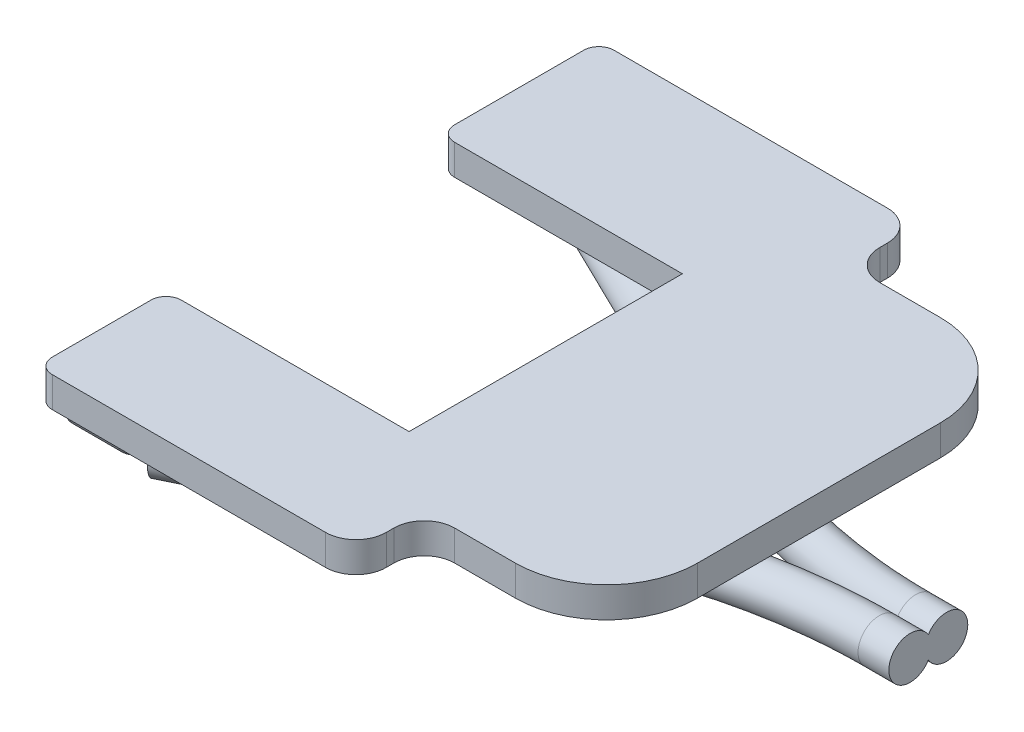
ISO-10303-21;
HEADER;
FILE_DESCRIPTION(('STEP AP214'),'2;1');
FILE_NAME('part.step','',(''),(''),'','','');
FILE_SCHEMA(('AUTOMOTIVE_DESIGN { 1 0 10303 214 1 1 1 1 }'));
ENDSEC;
DATA;
#1=APPLICATION_CONTEXT('core data for automotive mechanical design processes');
#2=APPLICATION_PROTOCOL_DEFINITION('international standard','automotive_design',2000,#1);
#3=PRODUCT_CONTEXT('',#1,'mechanical');
#4=PRODUCT('Part','Part','',(#3));
#5=PRODUCT_RELATED_PRODUCT_CATEGORY('part','',(#4));
#6=PRODUCT_DEFINITION_FORMATION('','',#4);
#7=PRODUCT_DEFINITION_CONTEXT('part definition',#1,'design');
#8=PRODUCT_DEFINITION('design','',#6,#7);
#9=PRODUCT_DEFINITION_SHAPE('','',#8);
#10=(LENGTH_UNIT() NAMED_UNIT(*) SI_UNIT(.MILLI.,.METRE.));
#11=(NAMED_UNIT(*) PLANE_ANGLE_UNIT() SI_UNIT($,.RADIAN.));
#12=(NAMED_UNIT(*) SI_UNIT($,.STERADIAN.) SOLID_ANGLE_UNIT());
#13=UNCERTAINTY_MEASURE_WITH_UNIT(LENGTH_MEASURE(1.E-05),#10,'distance_accuracy_value','');
#14=(GEOMETRIC_REPRESENTATION_CONTEXT(3) GLOBAL_UNCERTAINTY_ASSIGNED_CONTEXT((#13)) GLOBAL_UNIT_ASSIGNED_CONTEXT((#10,
#11,#12)) REPRESENTATION_CONTEXT('',''));
#15=CARTESIAN_POINT('',(0.,0.,0.));
#16=DIRECTION('',(0.,0.,1.));
#17=DIRECTION('',(1.,0.,0.));
#18=AXIS2_PLACEMENT_3D('',#15,#16,#17);
#19=CARTESIAN_POINT('',(0.,-1.,0.));
#20=DIRECTION('',(0.,-1.,0.));
#21=DIRECTION('',(0.,0.,-1.));
#22=AXIS2_PLACEMENT_3D('',#19,#20,#21);
#23=PLANE('',#22);
#24=DIRECTION('',(0.,0.,-1.));
#25=VECTOR('',#24,1.);
#26=CARTESIAN_POINT('',(-5.75232778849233,-1.,-5.10305783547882));
#27=LINE('',#26,#25);
#28=CARTESIAN_POINT('',(-5.75232778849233,-1.,-5.60305783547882));
#29=VERTEX_POINT('',#28);
#30=CARTESIAN_POINT('',(-5.75232778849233,-1.,-8.60305783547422));
#31=VERTEX_POINT('',#30);
#32=EDGE_CURVE('P0_E249',#29,#31,#27,.T.);
#33=ORIENTED_EDGE('',*,*,#32,.F.);
#34=DIRECTION('',(1.,0.,0.));
#35=VECTOR('',#34,1.);
#36=CARTESIAN_POINT('',(-5.25232778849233,-1.,-5.60305783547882));
#37=LINE('',#36,#35);
#38=CARTESIAN_POINT('',(-7.35232778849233,-1.,-5.60305783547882));
#39=VERTEX_POINT('',#38);
#40=EDGE_CURVE('P0_E243',#39,#29,#37,.T.);
#41=ORIENTED_EDGE('',*,*,#40,.F.);
#42=DIRECTION('',(0.,0.,1.));
#43=VECTOR('',#42,1.);
#44=CARTESIAN_POINT('',(-7.35232778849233,-1.,-5.10305783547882));
#45=LINE('',#44,#43);
#46=CARTESIAN_POINT('',(-7.35232778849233,-1.,-8.60305783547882));
#47=VERTEX_POINT('',#46);
#48=EDGE_CURVE('P0_E246',#47,#39,#45,.T.);
#49=ORIENTED_EDGE('',*,*,#48,.F.);
#50=DIRECTION('',(-1.,0.,0.));
#51=VECTOR('',#50,1.);
#52=CARTESIAN_POINT('',(-5.25232778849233,-1.,-8.60305783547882));
#53=LINE('',#52,#51);
#54=EDGE_CURVE('P0_E458',#31,#47,#53,.T.);
#55=ORIENTED_EDGE('',*,*,#54,.F.);
#56=EDGE_LOOP('',(#33,#41,#49,#55));
#57=FACE_BOUND('',#56,.T.);
#58=ADVANCED_FACE('P0_F16',(#57),#23,.T.);
#59=CARTESIAN_POINT('',(0.,-1.,0.));
#60=DIRECTION('',(0.,-1.,0.));
#61=DIRECTION('',(0.,0.,-1.));
#62=AXIS2_PLACEMENT_3D('',#59,#60,#61);
#63=PLANE('',#62);
#64=DIRECTION('',(-1.,0.,0.));
#65=VECTOR('',#64,1.);
#66=CARTESIAN_POINT('',(0.,-1.,5.60305783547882));
#67=LINE('',#66,#65);
#68=CARTESIAN_POINT('',(-5.75232778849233,-1.,5.60305783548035));
#69=VERTEX_POINT('',#68);
#70=CARTESIAN_POINT('',(-7.35232778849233,-1.,5.60305783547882));
#71=VERTEX_POINT('',#70);
#72=EDGE_CURVE('P0_E427',#69,#71,#67,.T.);
#73=ORIENTED_EDGE('',*,*,#72,.F.);
#74=DIRECTION('',(0.,0.,-1.));
#75=VECTOR('',#74,1.);
#76=CARTESIAN_POINT('',(-5.75232778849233,-1.,0.));
#77=LINE('',#76,#75);
#78=CARTESIAN_POINT('',(-5.75232778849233,-1.,8.60305783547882));
#79=VERTEX_POINT('',#78);
#80=EDGE_CURVE('P0_E421',#79,#69,#77,.T.);
#81=ORIENTED_EDGE('',*,*,#80,.F.);
#82=DIRECTION('',(1.,0.,0.));
#83=VECTOR('',#82,1.);
#84=CARTESIAN_POINT('',(0.,-1.,8.60305783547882));
#85=LINE('',#84,#83);
#86=CARTESIAN_POINT('',(-7.35232778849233,-1.,8.60305783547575));
#87=VERTEX_POINT('',#86);
#88=EDGE_CURVE('P0_E219',#87,#79,#85,.T.);
#89=ORIENTED_EDGE('',*,*,#88,.F.);
#90=DIRECTION('',(0.,0.,1.));
#91=VECTOR('',#90,1.);
#92=CARTESIAN_POINT('',(-7.35232778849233,-1.,0.));
#93=LINE('',#92,#91);
#94=EDGE_CURVE('P0_E488',#71,#87,#93,.T.);
#95=ORIENTED_EDGE('',*,*,#94,.F.);
#96=EDGE_LOOP('',(#73,#81,#89,#95));
#97=FACE_BOUND('',#96,.T.);
#98=ADVANCED_FACE('P0_F492',(#97),#63,.T.);
#99=CARTESIAN_POINT('',(-5.75232778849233,-0.5,-5.60305783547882));
#100=DIRECTION('',(1.,0.,0.));
#101=DIRECTION('',(0.,0.,-1.));
#102=AXIS2_PLACEMENT_3D('',#99,#100,#101);
#103=SPHERICAL_SURFACE('',#102,0.5);
#104=CARTESIAN_POINT('',(-5.75232778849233,-0.5,-5.60305783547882));
#105=DIRECTION('',(1.,0.,0.));
#106=DIRECTION('',(0.,0.,-1.));
#107=AXIS2_PLACEMENT_3D('',#104,#105,#106);
#108=CIRCLE('',#107,0.5);
#109=CARTESIAN_POINT('',(-5.75232778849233,-0.5,-5.10305783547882));
#110=VERTEX_POINT('',#109);
#111=EDGE_CURVE('P0_E238',#29,#110,#108,.F.);
#112=ORIENTED_EDGE('',*,*,#111,.F.);
#113=CARTESIAN_POINT('',(-5.75232778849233,-0.5,-5.60305783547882));
#114=DIRECTION('',(0.,0.,-1.));
#115=DIRECTION('',(-1.,0.,0.));
#116=AXIS2_PLACEMENT_3D('',#113,#114,#115);
#117=CIRCLE('',#116,0.5);
#118=CARTESIAN_POINT('',(-5.25232778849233,-0.5,-5.60305783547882));
#119=VERTEX_POINT('',#118);
#120=EDGE_CURVE('P0_E210',#119,#29,#117,.T.);
#121=ORIENTED_EDGE('',*,*,#120,.F.);
#122=CARTESIAN_POINT('',(-5.75232778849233,-0.5,-5.60305783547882));
#123=DIRECTION('',(0.,-1.,0.));
#124=DIRECTION('',(1.,0.,0.));
#125=AXIS2_PLACEMENT_3D('',#122,#123,#124);
#126=CIRCLE('',#125,0.5);
#127=EDGE_CURVE('P0_E19',#119,#110,#126,.T.);
#128=ORIENTED_EDGE('',*,*,#127,.T.);
#129=EDGE_LOOP('',(#112,#121,#128));
#130=FACE_BOUND('',#129,.T.);
#131=ADVANCED_FACE('P0_F490',(#130),#103,.T.);
#132=CARTESIAN_POINT('',(-5.25232778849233,-0.5,-5.60305783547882));
#133=DIRECTION('',(1.,0.,0.));
#134=DIRECTION('',(0.,0.,-1.));
#135=AXIS2_PLACEMENT_3D('',#132,#133,#134);
#136=CYLINDRICAL_SURFACE('',#135,0.5);
#137=ORIENTED_EDGE('',*,*,#111,.T.);
#138=DIRECTION('',(1.,0.,0.));
#139=VECTOR('',#138,1.);
#140=CARTESIAN_POINT('',(0.,-0.5,-5.10305783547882));
#141=LINE('',#140,#139);
#142=CARTESIAN_POINT('',(-7.35232778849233,-0.5,-5.10305783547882));
#143=VERTEX_POINT('',#142);
#144=EDGE_CURVE('P0_E257',#110,#143,#141,.F.);
#145=ORIENTED_EDGE('',*,*,#144,.T.);
#146=CARTESIAN_POINT('',(-7.35232778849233,-0.5,-5.60305783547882));
#147=DIRECTION('',(1.,0.,0.));
#148=DIRECTION('',(0.,0.,-1.));
#149=AXIS2_PLACEMENT_3D('',#146,#147,#148);
#150=CIRCLE('',#149,0.5);
#151=EDGE_CURVE('P0_E253',#39,#143,#150,.F.);
#152=ORIENTED_EDGE('',*,*,#151,.F.);
#153=ORIENTED_EDGE('',*,*,#40,.T.);
#154=EDGE_LOOP('',(#137,#145,#152,#153));
#155=FACE_BOUND('',#154,.T.);
#156=ADVANCED_FACE('P0_F255',(#155),#136,.T.);
#157=CARTESIAN_POINT('',(-7.35232778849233,-0.5,-5.60305783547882));
#158=DIRECTION('',(1.,0.,0.));
#159=DIRECTION('',(0.,0.,-1.));
#160=AXIS2_PLACEMENT_3D('',#157,#158,#159);
#161=SPHERICAL_SURFACE('',#160,0.5);
#162=CARTESIAN_POINT('',(-7.35232778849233,-0.5,-5.10305783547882));
#163=CARTESIAN_POINT('',(-7.38045693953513,-0.5,-5.10303394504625));
#164=CARTESIAN_POINT('',(-7.40857895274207,-0.5,-5.1054301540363));
#165=CARTESIAN_POINT('',(-7.46400595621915,-0.5,-5.11488647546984));
#166=CARTESIAN_POINT('',(-7.49131156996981,-0.5,-5.12194292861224));
#167=CARTESIAN_POINT('',(-7.54436234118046,-0.5,-5.14054841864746));
#168=CARTESIAN_POINT('',(-7.57010674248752,-0.5,-5.15209961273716));
#169=CARTESIAN_POINT('',(-7.61928674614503,-0.5,-5.17935660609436));
#170=CARTESIAN_POINT('',(-7.64272275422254,-0.5,-5.19506167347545));
#171=CARTESIAN_POINT('',(-7.68662774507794,-0.5,-5.23018508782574));
#172=CARTESIAN_POINT('',(-7.70709644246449,-0.5,-5.24960379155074));
#173=CARTESIAN_POINT('',(-7.74448295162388,-0.5,-5.29160225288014));
#174=CARTESIAN_POINT('',(-7.76140082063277,-0.5,-5.31418195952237));
#175=CARTESIAN_POINT('',(-7.79120990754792,-0.5,-5.36186573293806));
#176=CARTESIAN_POINT('',(-7.80409990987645,-0.5,-5.38697055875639));
#177=CARTESIAN_POINT('',(-7.82547553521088,-0.5,-5.43898299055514));
#178=CARTESIAN_POINT('',(-7.83396373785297,-0.5,-5.465889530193));
#179=CARTESIAN_POINT('',(-7.84418535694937,-0.5,-5.51131024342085));
#180=CARTESIAN_POINT('',(-7.84723692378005,-0.5,-5.52953868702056));
#181=CARTESIAN_POINT('',(-7.85130787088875,-0.5,-5.56619481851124));
#182=CARTESIAN_POINT('',(-7.85233013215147,-0.5,-5.58462218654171));
#183=CARTESIAN_POINT('',(-7.85232778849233,-0.5,-5.60305783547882));
#184=B_SPLINE_CURVE_WITH_KNOTS('',3,(#162,#163,#164,#165,#166,#167,#168,#169,#170,#171,#172,
#173,#174,#175,#176,#177,#178,#179,#180,#181,#182,#183),.UNSPECIFIED.,.F.,.F.,(4,2,2,2,2,2,2,2,
2,2,4),(0.,0.084275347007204,0.168484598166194,0.252734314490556,0.336969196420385,
0.421212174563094,0.505453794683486,0.589720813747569,0.673938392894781,0.729279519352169,
0.784542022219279),.UNSPECIFIED.);
#185=CARTESIAN_POINT('',(-7.85232778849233,-0.5,-5.60305783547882));
#186=VERTEX_POINT('',#185);
#187=EDGE_CURVE('P0_E264',#143,#186,#184,.T.);
#188=ORIENTED_EDGE('',*,*,#187,.T.);
#189=CARTESIAN_POINT('',(-7.35232778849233,-0.5,-5.60305783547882));
#190=DIRECTION('',(0.,0.,1.));
#191=DIRECTION('',(1.,0.,0.));
#192=AXIS2_PLACEMENT_3D('',#189,#190,#191);
#193=CIRCLE('',#192,0.5);
#194=EDGE_CURVE('P0_E260',#39,#186,#193,.F.);
#195=ORIENTED_EDGE('',*,*,#194,.F.);
#196=ORIENTED_EDGE('',*,*,#151,.T.);
#197=EDGE_LOOP('',(#188,#195,#196));
#198=FACE_BOUND('',#197,.T.);
#199=ADVANCED_FACE('P0_F263',(#198),#161,.T.);
#200=CARTESIAN_POINT('',(-7.35232778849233,-0.5,-5.10305783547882));
#201=DIRECTION('',(0.,0.,1.));
#202=DIRECTION('',(1.,0.,0.));
#203=AXIS2_PLACEMENT_3D('',#200,#201,#202);
#204=CYLINDRICAL_SURFACE('',#203,0.5);
#205=CARTESIAN_POINT('',(-7.35232778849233,-0.5,-8.60305783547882));
#206=DIRECTION('',(0.,0.,-1.));
#207=DIRECTION('',(1.,0.,0.));
#208=AXIS2_PLACEMENT_3D('',#205,#206,#207);
#209=CIRCLE('',#208,0.5);
#210=CARTESIAN_POINT('',(-7.85232778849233,-0.5,-8.60305783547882));
#211=VERTEX_POINT('',#210);
#212=EDGE_CURVE('P0_E270',#47,#211,#209,.T.);
#213=ORIENTED_EDGE('',*,*,#212,.F.);
#214=ORIENTED_EDGE('',*,*,#48,.T.);
#215=ORIENTED_EDGE('',*,*,#194,.T.);
#216=DIRECTION('',(0.,0.,1.));
#217=VECTOR('',#216,1.);
#218=CARTESIAN_POINT('',(-7.85232778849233,-0.5,0.));
#219=LINE('',#218,#217);
#220=EDGE_CURVE('P0_E628',#186,#211,#219,.F.);
#221=ORIENTED_EDGE('',*,*,#220,.T.);
#222=EDGE_LOOP('',(#213,#214,#215,#221));
#223=FACE_BOUND('',#222,.T.);
#224=ADVANCED_FACE('P0_F268',(#223),#204,.T.);
#225=CARTESIAN_POINT('',(-7.35232778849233,-0.5,-8.60305783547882));
#226=DIRECTION('',(1.,0.,0.));
#227=DIRECTION('',(0.,0.,-1.));
#228=AXIS2_PLACEMENT_3D('',#225,#226,#227);
#229=SPHERICAL_SURFACE('',#228,0.5);
#230=CARTESIAN_POINT('',(-7.35232778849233,-0.5,-8.60305783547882));
#231=DIRECTION('',(0.,1.,0.));
#232=DIRECTION('',(1.,0.,0.));
#233=AXIS2_PLACEMENT_3D('',#230,#231,#232);
#234=CIRCLE('',#233,0.5);
#235=CARTESIAN_POINT('',(-7.35232778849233,-0.5,-9.10305783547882));
#236=VERTEX_POINT('',#235);
#237=EDGE_CURVE('P0_E627',#211,#236,#234,.F.);
#238=ORIENTED_EDGE('',*,*,#237,.T.);
#239=CARTESIAN_POINT('',(-7.35232778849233,-0.5,-8.60305783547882));
#240=DIRECTION('',(-1.,0.,0.));
#241=DIRECTION('',(0.,0.,1.));
#242=AXIS2_PLACEMENT_3D('',#239,#240,#241);
#243=CIRCLE('',#242,0.5);
#244=EDGE_CURVE('P0_E273',#47,#236,#243,.F.);
#245=ORIENTED_EDGE('',*,*,#244,.F.);
#246=ORIENTED_EDGE('',*,*,#212,.T.);
#247=EDGE_LOOP('',(#238,#245,#246));
#248=FACE_BOUND('',#247,.T.);
#249=ADVANCED_FACE('P0_F467',(#248),#229,.T.);
#250=CARTESIAN_POINT('',(-5.25232778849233,-0.5,-8.60305783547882));
#251=DIRECTION('',(-1.,0.,0.));
#252=DIRECTION('',(0.,0.,1.));
#253=AXIS2_PLACEMENT_3D('',#250,#251,#252);
#254=CYLINDRICAL_SURFACE('',#253,0.5);
#255=CARTESIAN_POINT('',(-5.75232778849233,-0.5,-8.60305783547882));
#256=DIRECTION('',(1.,0.,0.));
#257=DIRECTION('',(0.,0.,-1.));
#258=AXIS2_PLACEMENT_3D('',#255,#256,#257);
#259=CIRCLE('',#258,0.5);
#260=CARTESIAN_POINT('',(-5.75232778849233,-0.5,-9.10305783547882));
#261=VERTEX_POINT('',#260);
#262=EDGE_CURVE('P0_E455',#31,#261,#259,.T.);
#263=ORIENTED_EDGE('',*,*,#262,.F.);
#264=ORIENTED_EDGE('',*,*,#54,.T.);
#265=ORIENTED_EDGE('',*,*,#244,.T.);
#266=DIRECTION('',(1.,0.,0.));
#267=VECTOR('',#266,1.);
#268=CARTESIAN_POINT('',(0.,-0.5,-9.10305783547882));
#269=LINE('',#268,#267);
#270=EDGE_CURVE('P0_E625',#236,#261,#269,.T.);
#271=ORIENTED_EDGE('',*,*,#270,.T.);
#272=EDGE_LOOP('',(#263,#264,#265,#271));
#273=FACE_BOUND('',#272,.T.);
#274=ADVANCED_FACE('P0_F447',(#273),#254,.T.);
#275=CARTESIAN_POINT('',(-5.75232778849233,-0.5,-8.60305783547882));
#276=DIRECTION('',(1.,0.,0.));
#277=DIRECTION('',(0.,0.,-1.));
#278=AXIS2_PLACEMENT_3D('',#275,#276,#277);
#279=SPHERICAL_SURFACE('',#278,0.5);
#280=CARTESIAN_POINT('',(-5.75232778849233,-0.5,-9.10305783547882));
#281=CARTESIAN_POINT('',(-5.72419863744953,-0.5,-9.10308172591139));
#282=CARTESIAN_POINT('',(-5.69607662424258,-0.5,-9.10068551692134));
#283=CARTESIAN_POINT('',(-5.6406496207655,-0.5,-9.0912291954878));
#284=CARTESIAN_POINT('',(-5.61334400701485,-0.5,-9.08417274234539));
#285=CARTESIAN_POINT('',(-5.56029323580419,-0.5,-9.06556725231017));
#286=CARTESIAN_POINT('',(-5.53454883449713,-0.5,-9.05401605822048));
#287=CARTESIAN_POINT('',(-5.48536883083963,-0.5,-9.02675906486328));
#288=CARTESIAN_POINT('',(-5.46193282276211,-0.5,-9.01105399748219));
#289=CARTESIAN_POINT('',(-5.41802783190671,-0.5,-8.97593058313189));
#290=CARTESIAN_POINT('',(-5.39755913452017,-0.5,-8.9565118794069));
#291=CARTESIAN_POINT('',(-5.36017262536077,-0.5,-8.9145134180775));
#292=CARTESIAN_POINT('',(-5.34325475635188,-0.5,-8.89193371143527));
#293=CARTESIAN_POINT('',(-5.31344566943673,-0.5,-8.84424993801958));
#294=CARTESIAN_POINT('',(-5.30055566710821,-0.5,-8.81914511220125));
#295=CARTESIAN_POINT('',(-5.27918004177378,-0.5,-8.7671326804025));
#296=CARTESIAN_POINT('',(-5.27069183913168,-0.5,-8.74022614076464));
#297=CARTESIAN_POINT('',(-5.26047022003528,-0.5,-8.69480542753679));
#298=CARTESIAN_POINT('',(-5.2574186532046,-0.5,-8.67657698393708));
#299=CARTESIAN_POINT('',(-5.2533477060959,-0.5,-8.6399208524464));
#300=CARTESIAN_POINT('',(-5.25232544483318,-0.5,-8.62149348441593));
#301=CARTESIAN_POINT('',(-5.25232778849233,-0.5,-8.60305783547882));
#302=B_SPLINE_CURVE_WITH_KNOTS('',3,(#280,#281,#282,#283,#284,#285,#286,#287,#288,#289,#290,
#291,#292,#293,#294,#295,#296,#297,#298,#299,#300,#301),.UNSPECIFIED.,.F.,.F.,(4,2,2,2,2,2,2,2,
2,2,4),(0.,0.0842753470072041,0.168484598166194,0.252734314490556,0.336969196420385,
0.421212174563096,0.505453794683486,0.589720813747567,0.673938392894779,0.729279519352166,
0.784542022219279),.UNSPECIFIED.);
#303=CARTESIAN_POINT('',(-5.25232778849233,-0.5,-8.60305783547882));
#304=VERTEX_POINT('',#303);
#305=EDGE_CURVE('P0_E624',#261,#304,#302,.T.);
#306=ORIENTED_EDGE('',*,*,#305,.T.);
#307=CARTESIAN_POINT('',(-5.75232778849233,-0.5,-8.60305783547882));
#308=DIRECTION('',(0.,0.,-1.));
#309=DIRECTION('',(-1.,0.,0.));
#310=AXIS2_PLACEMENT_3D('',#307,#308,#309);
#311=CIRCLE('',#310,0.5);
#312=EDGE_CURVE('P0_E432',#31,#304,#311,.F.);
#313=ORIENTED_EDGE('',*,*,#312,.F.);
#314=ORIENTED_EDGE('',*,*,#262,.T.);
#315=EDGE_LOOP('',(#306,#313,#314));
#316=FACE_BOUND('',#315,.T.);
#317=ADVANCED_FACE('P0_F441',(#316),#279,.T.);
#318=CARTESIAN_POINT('',(-5.75232778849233,-0.5,-5.10305783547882));
#319=DIRECTION('',(0.,0.,-1.));
#320=DIRECTION('',(-1.,0.,0.));
#321=AXIS2_PLACEMENT_3D('',#318,#319,#320);
#322=CYLINDRICAL_SURFACE('',#321,0.5);
#323=ORIENTED_EDGE('',*,*,#312,.T.);
#324=DIRECTION('',(0.,0.,1.));
#325=VECTOR('',#324,1.);
#326=CARTESIAN_POINT('',(-5.25232778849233,-0.5,0.));
#327=LINE('',#326,#325);
#328=EDGE_CURVE('P0_E621',#304,#119,#327,.T.);
#329=ORIENTED_EDGE('',*,*,#328,.T.);
#330=ORIENTED_EDGE('',*,*,#120,.T.);
#331=ORIENTED_EDGE('',*,*,#32,.T.);
#332=EDGE_LOOP('',(#323,#329,#330,#331));
#333=FACE_BOUND('',#332,.T.);
#334=ADVANCED_FACE('P0_F437',(#333),#322,.T.);
#335=CARTESIAN_POINT('',(-7.35232778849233,-0.5,5.60305783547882));
#336=DIRECTION('',(1.,0.,0.));
#337=DIRECTION('',(0.,0.,-1.));
#338=AXIS2_PLACEMENT_3D('',#335,#336,#337);
#339=SPHERICAL_SURFACE('',#338,0.5);
#340=CARTESIAN_POINT('',(-7.35232778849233,-0.5,5.60305783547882));
#341=DIRECTION('',(0.,1.,0.));
#342=DIRECTION('',(1.,0.,0.));
#343=AXIS2_PLACEMENT_3D('',#340,#341,#342);
#344=CIRCLE('',#343,0.5);
#345=CARTESIAN_POINT('',(-7.85232778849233,-0.5,5.60305783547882));
#346=VERTEX_POINT('',#345);
#347=CARTESIAN_POINT('',(-7.35232778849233,-0.5,5.10305783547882));
#348=VERTEX_POINT('',#347);
#349=EDGE_CURVE('P0_E400',#346,#348,#344,.F.);
#350=ORIENTED_EDGE('',*,*,#349,.T.);
#351=CARTESIAN_POINT('',(-7.35232778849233,-0.5,5.60305783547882));
#352=DIRECTION('',(-1.,0.,0.));
#353=DIRECTION('',(0.,0.,1.));
#354=AXIS2_PLACEMENT_3D('',#351,#352,#353);
#355=CIRCLE('',#354,0.5);
#356=EDGE_CURVE('P0_E422',#71,#348,#355,.F.);
#357=ORIENTED_EDGE('',*,*,#356,.F.);
#358=CARTESIAN_POINT('',(-7.35232778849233,-0.5,5.60305783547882));
#359=DIRECTION('',(0.,0.,1.));
#360=DIRECTION('',(1.,0.,0.));
#361=AXIS2_PLACEMENT_3D('',#358,#359,#360);
#362=CIRCLE('',#361,0.5);
#363=EDGE_CURVE('P0_E662',#346,#71,#362,.T.);
#364=ORIENTED_EDGE('',*,*,#363,.F.);
#365=EDGE_LOOP('',(#350,#357,#364));
#366=FACE_BOUND('',#365,.T.);
#367=ADVANCED_FACE('P0_F434',(#366),#339,.T.);
#368=CARTESIAN_POINT('',(0.,-0.5,5.60305783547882));
#369=DIRECTION('',(-1.,0.,0.));
#370=DIRECTION('',(0.,0.,1.));
#371=AXIS2_PLACEMENT_3D('',#368,#369,#370);
#372=CYLINDRICAL_SURFACE('',#371,0.5);
#373=ORIENTED_EDGE('',*,*,#356,.T.);
#374=DIRECTION('',(1.,0.,0.));
#375=VECTOR('',#374,1.);
#376=CARTESIAN_POINT('',(0.,-0.5,5.10305783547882));
#377=LINE('',#376,#375);
#378=CARTESIAN_POINT('',(-5.75232778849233,-0.5,5.10305783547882));
#379=VERTEX_POINT('',#378);
#380=EDGE_CURVE('P0_E399',#348,#379,#377,.T.);
#381=ORIENTED_EDGE('',*,*,#380,.T.);
#382=CARTESIAN_POINT('',(-5.75232778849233,-0.5,5.60305783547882));
#383=DIRECTION('',(1.,0.,0.));
#384=DIRECTION('',(0.,0.,-1.));
#385=AXIS2_PLACEMENT_3D('',#382,#383,#384);
#386=CIRCLE('',#385,0.5);
#387=EDGE_CURVE('P0_E418',#69,#379,#386,.T.);
#388=ORIENTED_EDGE('',*,*,#387,.F.);
#389=ORIENTED_EDGE('',*,*,#72,.T.);
#390=EDGE_LOOP('',(#373,#381,#388,#389));
#391=FACE_BOUND('',#390,.T.);
#392=ADVANCED_FACE('P0_F409',(#391),#372,.T.);
#393=CARTESIAN_POINT('',(-5.75232778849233,-0.5,5.60305783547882));
#394=DIRECTION('',(1.,0.,0.));
#395=DIRECTION('',(0.,0.,-1.));
#396=AXIS2_PLACEMENT_3D('',#393,#394,#395);
#397=SPHERICAL_SURFACE('',#396,0.5);
#398=CARTESIAN_POINT('',(-5.75232778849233,-0.5,5.60305783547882));
#399=DIRECTION('',(0.,0.,-1.));
#400=DIRECTION('',(-1.,0.,0.));
#401=AXIS2_PLACEMENT_3D('',#398,#399,#400);
#402=CIRCLE('',#401,0.5);
#403=CARTESIAN_POINT('',(-5.25232778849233,-0.5,5.60305783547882));
#404=VERTEX_POINT('',#403);
#405=EDGE_CURVE('P0_E722',#69,#404,#402,.F.);
#406=ORIENTED_EDGE('',*,*,#405,.F.);
#407=ORIENTED_EDGE('',*,*,#387,.T.);
#408=CARTESIAN_POINT('',(-5.75232778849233,-0.5,5.10305783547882));
#409=CARTESIAN_POINT('',(-5.72419863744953,-0.5,5.10303394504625));
#410=CARTESIAN_POINT('',(-5.69607662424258,-0.5,5.1054301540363));
#411=CARTESIAN_POINT('',(-5.6406496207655,-0.5,5.11488647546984));
#412=CARTESIAN_POINT('',(-5.61334400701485,-0.5,5.12194292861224));
#413=CARTESIAN_POINT('',(-5.56029323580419,-0.5,5.14054841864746));
#414=CARTESIAN_POINT('',(-5.53454883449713,-0.5,5.15209961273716));
#415=CARTESIAN_POINT('',(-5.48536883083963,-0.5,5.17935660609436));
#416=CARTESIAN_POINT('',(-5.46193282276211,-0.5,5.19506167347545));
#417=CARTESIAN_POINT('',(-5.41802783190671,-0.5,5.23018508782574));
#418=CARTESIAN_POINT('',(-5.39755913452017,-0.5,5.24960379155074));
#419=CARTESIAN_POINT('',(-5.36017262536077,-0.5,5.29160225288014));
#420=CARTESIAN_POINT('',(-5.34325475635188,-0.5,5.31418195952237));
#421=CARTESIAN_POINT('',(-5.31344566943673,-0.5,5.36186573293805));
#422=CARTESIAN_POINT('',(-5.30055566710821,-0.5,5.38697055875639));
#423=CARTESIAN_POINT('',(-5.27918004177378,-0.5,5.43898299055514));
#424=CARTESIAN_POINT('',(-5.27069183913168,-0.5,5.465889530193));
#425=CARTESIAN_POINT('',(-5.26047022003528,-0.5,5.51131024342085));
#426=CARTESIAN_POINT('',(-5.2574186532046,-0.5,5.52953868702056));
#427=CARTESIAN_POINT('',(-5.2533477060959,-0.5,5.56619481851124));
#428=CARTESIAN_POINT('',(-5.25232544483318,-0.5,5.58462218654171));
#429=CARTESIAN_POINT('',(-5.25232778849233,-0.5,5.60305783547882));
#430=B_SPLINE_CURVE_WITH_KNOTS('',3,(#408,#409,#410,#411,#412,#413,#414,#415,#416,#417,#418,
#419,#420,#421,#422,#423,#424,#425,#426,#427,#428,#429),.UNSPECIFIED.,.F.,.F.,(4,2,2,2,2,2,2,2,
2,2,4),(0.,0.084275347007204,0.168484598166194,0.252734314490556,0.336969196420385,
0.421212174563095,0.505453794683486,0.589720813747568,0.67393839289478,0.729279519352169,
0.784542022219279),.UNSPECIFIED.);
#431=EDGE_CURVE('P0_E392',#379,#404,#430,.T.);
#432=ORIENTED_EDGE('',*,*,#431,.T.);
#433=EDGE_LOOP('',(#406,#407,#432));
#434=FACE_BOUND('',#433,.T.);
#435=ADVANCED_FACE('P0_F402',(#434),#397,.T.);
#436=CARTESIAN_POINT('',(-5.75232778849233,-0.5,0.));
#437=DIRECTION('',(0.,0.,-1.));
#438=DIRECTION('',(-1.,0.,0.));
#439=AXIS2_PLACEMENT_3D('',#436,#437,#438);
#440=CYLINDRICAL_SURFACE('',#439,0.5);
#441=ORIENTED_EDGE('',*,*,#405,.T.);
#442=DIRECTION('',(0.,0.,1.));
#443=VECTOR('',#442,1.);
#444=CARTESIAN_POINT('',(-5.25232778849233,-0.5,0.));
#445=LINE('',#444,#443);
#446=CARTESIAN_POINT('',(-5.25232778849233,-0.5,8.60305783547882));
#447=VERTEX_POINT('',#446);
#448=EDGE_CURVE('P0_E398',#404,#447,#445,.T.);
#449=ORIENTED_EDGE('',*,*,#448,.T.);
#450=CARTESIAN_POINT('',(-5.75232778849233,-0.5,8.60305783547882));
#451=DIRECTION('',(0.,0.,-1.));
#452=DIRECTION('',(1.,0.,0.));
#453=AXIS2_PLACEMENT_3D('',#450,#451,#452);
#454=CIRCLE('',#453,0.5);
#455=EDGE_CURVE('P0_E678',#79,#447,#454,.F.);
#456=ORIENTED_EDGE('',*,*,#455,.F.);
#457=ORIENTED_EDGE('',*,*,#80,.T.);
#458=EDGE_LOOP('',(#441,#449,#456,#457));
#459=FACE_BOUND('',#458,.T.);
#460=ADVANCED_FACE('P0_F408',(#459),#440,.T.);
#461=CARTESIAN_POINT('',(-5.75232778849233,-0.5,8.60305783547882));
#462=DIRECTION('',(1.,0.,0.));
#463=DIRECTION('',(0.,0.,-1.));
#464=AXIS2_PLACEMENT_3D('',#461,#462,#463);
#465=SPHERICAL_SURFACE('',#464,0.5);
#466=CARTESIAN_POINT('',(-5.75232778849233,-0.5,8.60305783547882));
#467=DIRECTION('',(0.,-1.,0.));
#468=DIRECTION('',(1.,0.,0.));
#469=AXIS2_PLACEMENT_3D('',#466,#467,#468);
#470=CIRCLE('',#469,0.5);
#471=CARTESIAN_POINT('',(-5.75232778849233,-0.5,9.10305783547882));
#472=VERTEX_POINT('',#471);
#473=EDGE_CURVE('P0_E368',#447,#472,#470,.T.);
#474=ORIENTED_EDGE('',*,*,#473,.T.);
#475=CARTESIAN_POINT('',(-5.75232778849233,-0.5,8.60305783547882));
#476=DIRECTION('',(1.,0.,0.));
#477=DIRECTION('',(0.,0.,-1.));
#478=AXIS2_PLACEMENT_3D('',#475,#476,#477);
#479=CIRCLE('',#478,0.5);
#480=EDGE_CURVE('P0_E675',#79,#472,#479,.F.);
#481=ORIENTED_EDGE('',*,*,#480,.F.);
#482=ORIENTED_EDGE('',*,*,#455,.T.);
#483=EDGE_LOOP('',(#474,#481,#482));
#484=FACE_BOUND('',#483,.T.);
#485=ADVANCED_FACE('P0_F684',(#484),#465,.T.);
#486=CARTESIAN_POINT('',(0.,-0.5,8.60305783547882));
#487=DIRECTION('',(1.,0.,0.));
#488=DIRECTION('',(0.,0.,-1.));
#489=AXIS2_PLACEMENT_3D('',#486,#487,#488);
#490=CYLINDRICAL_SURFACE('',#489,0.5);
#491=CARTESIAN_POINT('',(-7.35232778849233,-0.5,8.60305783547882));
#492=DIRECTION('',(1.,0.,0.));
#493=DIRECTION('',(0.,0.,-1.));
#494=AXIS2_PLACEMENT_3D('',#491,#492,#493);
#495=CIRCLE('',#494,0.5);
#496=CARTESIAN_POINT('',(-7.35232778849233,-0.5,9.10305783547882));
#497=VERTEX_POINT('',#496);
#498=EDGE_CURVE('P0_E663',#87,#497,#495,.F.);
#499=ORIENTED_EDGE('',*,*,#498,.F.);
#500=ORIENTED_EDGE('',*,*,#88,.T.);
#501=ORIENTED_EDGE('',*,*,#480,.T.);
#502=DIRECTION('',(1.,0.,0.));
#503=VECTOR('',#502,1.);
#504=CARTESIAN_POINT('',(0.,-0.5,9.10305783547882));
#505=LINE('',#504,#503);
#506=EDGE_CURVE('P0_E367',#472,#497,#505,.F.);
#507=ORIENTED_EDGE('',*,*,#506,.T.);
#508=EDGE_LOOP('',(#499,#500,#501,#507));
#509=FACE_BOUND('',#508,.T.);
#510=ADVANCED_FACE('P0_F686',(#509),#490,.T.);
#511=CARTESIAN_POINT('',(-7.35232778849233,-0.5,8.60305783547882));
#512=DIRECTION('',(1.,0.,0.));
#513=DIRECTION('',(0.,0.,-1.));
#514=AXIS2_PLACEMENT_3D('',#511,#512,#513);
#515=SPHERICAL_SURFACE('',#514,0.5);
#516=CARTESIAN_POINT('',(-7.35232778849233,-0.5,9.10305783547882));
#517=CARTESIAN_POINT('',(-7.38045693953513,-0.5,9.10308172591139));
#518=CARTESIAN_POINT('',(-7.40857895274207,-0.5,9.10068551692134));
#519=CARTESIAN_POINT('',(-7.46400595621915,-0.5,9.0912291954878));
#520=CARTESIAN_POINT('',(-7.49131156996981,-0.5,9.08417274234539));
#521=CARTESIAN_POINT('',(-7.54436234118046,-0.5,9.06556725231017));
#522=CARTESIAN_POINT('',(-7.57010674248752,-0.5,9.05401605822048));
#523=CARTESIAN_POINT('',(-7.61928674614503,-0.5,9.02675906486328));
#524=CARTESIAN_POINT('',(-7.64272275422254,-0.5,9.01105399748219));
#525=CARTESIAN_POINT('',(-7.68662774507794,-0.5,8.97593058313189));
#526=CARTESIAN_POINT('',(-7.70709644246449,-0.5,8.9565118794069));
#527=CARTESIAN_POINT('',(-7.74448295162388,-0.5,8.9145134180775));
#528=CARTESIAN_POINT('',(-7.76140082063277,-0.5,8.89193371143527));
#529=CARTESIAN_POINT('',(-7.79120990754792,-0.5,8.84424993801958));
#530=CARTESIAN_POINT('',(-7.80409990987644,-0.5,8.81914511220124));
#531=CARTESIAN_POINT('',(-7.82547553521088,-0.5,8.7671326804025));
#532=CARTESIAN_POINT('',(-7.83396373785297,-0.5,8.74022614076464));
#533=CARTESIAN_POINT('',(-7.84418535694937,-0.5,8.69480542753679));
#534=CARTESIAN_POINT('',(-7.84723692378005,-0.5,8.67657698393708));
#535=CARTESIAN_POINT('',(-7.85130787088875,-0.5,8.6399208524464));
#536=CARTESIAN_POINT('',(-7.85233013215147,-0.5,8.62149348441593));
#537=CARTESIAN_POINT('',(-7.85232778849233,-0.5,8.60305783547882));
#538=B_SPLINE_CURVE_WITH_KNOTS('',3,(#516,#517,#518,#519,#520,#521,#522,#523,#524,#525,#526,
#527,#528,#529,#530,#531,#532,#533,#534,#535,#536,#537),.UNSPECIFIED.,.F.,.F.,(4,2,2,2,2,2,2,2,
2,2,4),(0.,0.0842753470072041,0.168484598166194,0.252734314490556,0.336969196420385,
0.421212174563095,0.505453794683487,0.589720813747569,0.673938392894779,0.729279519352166,
0.784542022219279),.UNSPECIFIED.);
#539=CARTESIAN_POINT('',(-7.85232778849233,-0.5,8.60305783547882));
#540=VERTEX_POINT('',#539);
#541=EDGE_CURVE('P0_E359',#497,#540,#538,.T.);
#542=ORIENTED_EDGE('',*,*,#541,.T.);
#543=CARTESIAN_POINT('',(-7.35232778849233,-0.5,8.60305783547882));
#544=DIRECTION('',(0.,0.,1.));
#545=DIRECTION('',(1.,0.,0.));
#546=AXIS2_PLACEMENT_3D('',#543,#544,#545);
#547=CIRCLE('',#546,0.5);
#548=EDGE_CURVE('P0_E659',#87,#540,#547,.F.);
#549=ORIENTED_EDGE('',*,*,#548,.F.);
#550=ORIENTED_EDGE('',*,*,#498,.T.);
#551=EDGE_LOOP('',(#542,#549,#550));
#552=FACE_BOUND('',#551,.T.);
#553=ADVANCED_FACE('P0_F370',(#552),#515,.T.);
#554=CARTESIAN_POINT('',(-7.35232778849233,-0.5,0.));
#555=DIRECTION('',(0.,0.,1.));
#556=DIRECTION('',(1.,0.,0.));
#557=AXIS2_PLACEMENT_3D('',#554,#555,#556);
#558=CYLINDRICAL_SURFACE('',#557,0.5);
#559=ORIENTED_EDGE('',*,*,#363,.T.);
#560=ORIENTED_EDGE('',*,*,#94,.T.);
#561=ORIENTED_EDGE('',*,*,#548,.T.);
#562=DIRECTION('',(0.,0.,1.));
#563=VECTOR('',#562,1.);
#564=CARTESIAN_POINT('',(-7.85232778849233,-0.5,0.));
#565=LINE('',#564,#563);
#566=EDGE_CURVE('P0_E366',#540,#346,#565,.F.);
#567=ORIENTED_EDGE('',*,*,#566,.T.);
#568=EDGE_LOOP('',(#559,#560,#561,#567));
#569=FACE_BOUND('',#568,.T.);
#570=ADVANCED_FACE('P0_F380',(#569),#558,.T.);
#571=CARTESIAN_POINT('',(0.,-0.5,0.));
#572=DIRECTION('',(0.,1.,0.));
#573=DIRECTION('',(0.,0.,1.));
#574=AXIS2_PLACEMENT_3D('',#571,#572,#573);
#575=PLANE('',#574);
#576=ORIENTED_EDGE('',*,*,#541,.F.);
#577=ORIENTED_EDGE('',*,*,#506,.F.);
#578=ORIENTED_EDGE('',*,*,#473,.F.);
#579=ORIENTED_EDGE('',*,*,#448,.F.);
#580=ORIENTED_EDGE('',*,*,#431,.F.);
#581=ORIENTED_EDGE('',*,*,#380,.F.);
#582=ORIENTED_EDGE('',*,*,#349,.F.);
#583=ORIENTED_EDGE('',*,*,#566,.F.);
#584=EDGE_LOOP('',(#576,#577,#578,#579,#580,#581,#582,#583));
#585=FACE_BOUND('',#584,.T.);
#586=CARTESIAN_POINT('',(-7.75,-0.5,8.75));
#587=DIRECTION('',(0.,-1.,0.));
#588=DIRECTION('',(0.,0.,-1.));
#589=AXIS2_PLACEMENT_3D('',#586,#587,#588);
#590=CIRCLE('',#589,0.5);
#591=CARTESIAN_POINT('',(-8.25,-0.5,8.75));
#592=VERTEX_POINT('',#591);
#593=CARTESIAN_POINT('',(-7.75,-0.5,9.25));
#594=VERTEX_POINT('',#593);
#595=EDGE_CURVE('P0_E354',#592,#594,#590,.F.);
#596=ORIENTED_EDGE('',*,*,#595,.F.);
#597=DIRECTION('',(0.,0.,-1.));
#598=VECTOR('',#597,1.);
#599=CARTESIAN_POINT('',(-8.25,-0.5,5.));
#600=LINE('',#599,#598);
#601=CARTESIAN_POINT('',(-8.25,-0.5,5.5));
#602=VERTEX_POINT('',#601);
#603=EDGE_CURVE('P0_E608',#592,#602,#600,.T.);
#604=ORIENTED_EDGE('',*,*,#603,.T.);
#605=CARTESIAN_POINT('',(-7.75,-0.5,5.5));
#606=DIRECTION('',(0.,-1.,0.));
#607=DIRECTION('',(0.,0.,-1.));
#608=AXIS2_PLACEMENT_3D('',#605,#606,#607);
#609=CIRCLE('',#608,0.5);
#610=CARTESIAN_POINT('',(-7.75,-0.5,5.));
#611=VERTEX_POINT('',#610);
#612=EDGE_CURVE('P0_E623',#611,#602,#609,.F.);
#613=ORIENTED_EDGE('',*,*,#612,.F.);
#614=DIRECTION('',(1.,0.,0.));
#615=VECTOR('',#614,1.);
#616=CARTESIAN_POINT('',(-8.25,-0.5,5.));
#617=LINE('',#616,#615);
#618=CARTESIAN_POINT('',(-0.25,-0.5,5.));
#619=VERTEX_POINT('',#618);
#620=EDGE_CURVE('P0_E610',#611,#619,#617,.T.);
#621=ORIENTED_EDGE('',*,*,#620,.T.);
#622=DIRECTION('',(0.,0.,-1.));
#623=VECTOR('',#622,1.);
#624=CARTESIAN_POINT('',(-0.250000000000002,-0.5,-4.));
#625=LINE('',#624,#623);
#626=CARTESIAN_POINT('',(-0.250000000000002,-0.5,-4.));
#627=VERTEX_POINT('',#626);
#628=EDGE_CURVE('P0_E631',#619,#627,#625,.T.);
#629=ORIENTED_EDGE('',*,*,#628,.T.);
#630=DIRECTION('',(-1.,0.,0.));
#631=VECTOR('',#630,1.);
#632=CARTESIAN_POINT('',(-8.25,-0.5,-4.));
#633=LINE('',#632,#631);
#634=CARTESIAN_POINT('',(-7.75,-0.5,-4.));
#635=VERTEX_POINT('',#634);
#636=EDGE_CURVE('P0_E323',#627,#635,#633,.T.);
#637=ORIENTED_EDGE('',*,*,#636,.T.);
#638=CARTESIAN_POINT('',(-7.75,-0.5,-4.5));
#639=DIRECTION('',(0.,-1.,0.));
#640=DIRECTION('',(0.,0.,-1.));
#641=AXIS2_PLACEMENT_3D('',#638,#639,#640);
#642=CIRCLE('',#641,0.5);
#643=CARTESIAN_POINT('',(-8.25,-0.5,-4.5));
#644=VERTEX_POINT('',#643);
#645=EDGE_CURVE('P0_E320',#644,#635,#642,.F.);
#646=ORIENTED_EDGE('',*,*,#645,.F.);
#647=DIRECTION('',(0.,0.,-1.));
#648=VECTOR('',#647,1.);
#649=CARTESIAN_POINT('',(-8.25,-0.5,-9.25));
#650=LINE('',#649,#648);
#651=CARTESIAN_POINT('',(-8.25,-0.5,-8.75));
#652=VERTEX_POINT('',#651);
#653=EDGE_CURVE('P0_E641',#644,#652,#650,.T.);
#654=ORIENTED_EDGE('',*,*,#653,.T.);
#655=CARTESIAN_POINT('',(-7.75,-0.5,-8.75));
#656=DIRECTION('',(0.,-1.,0.));
#657=DIRECTION('',(0.,0.,-1.));
#658=AXIS2_PLACEMENT_3D('',#655,#656,#657);
#659=CIRCLE('',#658,0.5);
#660=CARTESIAN_POINT('',(-7.75,-0.5,-9.25));
#661=VERTEX_POINT('',#660);
#662=EDGE_CURVE('P0_E325',#661,#652,#659,.F.);
#663=ORIENTED_EDGE('',*,*,#662,.F.);
#664=DIRECTION('',(1.,0.,0.));
#665=VECTOR('',#664,1.);
#666=CARTESIAN_POINT('',(-8.25,-0.5,-9.25));
#667=LINE('',#666,#665);
#668=CARTESIAN_POINT('',(1.25,-0.5,-9.25));
#669=VERTEX_POINT('',#668);
#670=EDGE_CURVE('P0_E644',#661,#669,#667,.T.);
#671=ORIENTED_EDGE('',*,*,#670,.T.);
#672=CARTESIAN_POINT('',(1.25,-0.5,-8.25));
#673=DIRECTION('',(0.,-1.,0.));
#674=DIRECTION('',(0.,0.,-1.));
#675=AXIS2_PLACEMENT_3D('',#672,#673,#674);
#676=CIRCLE('',#675,1.);
#677=CARTESIAN_POINT('',(2.25,-0.5,-8.25));
#678=VERTEX_POINT('',#677);
#679=EDGE_CURVE('P0_E329',#678,#669,#676,.F.);
#680=ORIENTED_EDGE('',*,*,#679,.F.);
#681=DIRECTION('',(0.,0.,1.));
#682=VECTOR('',#681,1.);
#683=CARTESIAN_POINT('',(2.25,-0.5,-9.25));
#684=LINE('',#683,#682);
#685=CARTESIAN_POINT('',(2.25,-0.5,-8.));
#686=VERTEX_POINT('',#685);
#687=EDGE_CURVE('P0_E647',#678,#686,#684,.T.);
#688=ORIENTED_EDGE('',*,*,#687,.T.);
#689=CARTESIAN_POINT('',(3.25,-0.5,-8.));
#690=DIRECTION('',(0.,1.,0.));
#691=DIRECTION('',(0.,0.,1.));
#692=AXIS2_PLACEMENT_3D('',#689,#690,#691);
#693=CIRCLE('',#692,1.);
#694=CARTESIAN_POINT('',(3.25,-0.5,-7.));
#695=VERTEX_POINT('',#694);
#696=EDGE_CURVE('P0_E333',#686,#695,#693,.T.);
#697=ORIENTED_EDGE('',*,*,#696,.T.);
#698=DIRECTION('',(1.,0.,0.));
#699=VECTOR('',#698,1.);
#700=CARTESIAN_POINT('',(2.25,-0.5,-7.));
#701=LINE('',#700,#699);
#702=CARTESIAN_POINT('',(5.25,-0.5,-7.));
#703=VERTEX_POINT('',#702);
#704=EDGE_CURVE('P0_E336',#695,#703,#701,.T.);
#705=ORIENTED_EDGE('',*,*,#704,.T.);
#706=CARTESIAN_POINT('',(5.25,-0.5,-4.));
#707=DIRECTION('',(0.,-1.,0.));
#708=DIRECTION('',(0.,0.,-1.));
#709=AXIS2_PLACEMENT_3D('',#706,#707,#708);
#710=CIRCLE('',#709,3.);
#711=CARTESIAN_POINT('',(8.25,-0.5,-4.));
#712=VERTEX_POINT('',#711);
#713=EDGE_CURVE('P0_E337',#712,#703,#710,.F.);
#714=ORIENTED_EDGE('',*,*,#713,.F.);
#715=DIRECTION('',(0.,0.,1.));
#716=VECTOR('',#715,1.);
#717=CARTESIAN_POINT('',(8.25,-0.5,-7.));
#718=LINE('',#717,#716);
#719=CARTESIAN_POINT('',(8.25,-0.5,4.));
#720=VERTEX_POINT('',#719);
#721=EDGE_CURVE('P0_E344',#712,#720,#718,.T.);
#722=ORIENTED_EDGE('',*,*,#721,.T.);
#723=CARTESIAN_POINT('',(5.25,-0.5,4.));
#724=DIRECTION('',(0.,-1.,0.));
#725=DIRECTION('',(0.,0.,-1.));
#726=AXIS2_PLACEMENT_3D('',#723,#724,#725);
#727=CIRCLE('',#726,3.);
#728=CARTESIAN_POINT('',(5.25,-0.5,7.));
#729=VERTEX_POINT('',#728);
#730=EDGE_CURVE('P0_E341',#729,#720,#727,.F.);
#731=ORIENTED_EDGE('',*,*,#730,.F.);
#732=DIRECTION('',(-1.,0.,0.));
#733=VECTOR('',#732,1.);
#734=CARTESIAN_POINT('',(8.25,-0.5,7.));
#735=LINE('',#734,#733);
#736=CARTESIAN_POINT('',(3.25,-0.5,7.));
#737=VERTEX_POINT('',#736);
#738=EDGE_CURVE('P0_E654',#729,#737,#735,.T.);
#739=ORIENTED_EDGE('',*,*,#738,.T.);
#740=CARTESIAN_POINT('',(3.25,-0.5,8.));
#741=DIRECTION('',(0.,1.,0.));
#742=DIRECTION('',(0.,0.,1.));
#743=AXIS2_PLACEMENT_3D('',#740,#741,#742);
#744=CIRCLE('',#743,1.);
#745=CARTESIAN_POINT('',(2.25,-0.5,8.));
#746=VERTEX_POINT('',#745);
#747=EDGE_CURVE('P0_E346',#737,#746,#744,.T.);
#748=ORIENTED_EDGE('',*,*,#747,.T.);
#749=DIRECTION('',(0.,0.,1.));
#750=VECTOR('',#749,1.);
#751=CARTESIAN_POINT('',(2.25,-0.5,9.25));
#752=LINE('',#751,#750);
#753=CARTESIAN_POINT('',(2.25,-0.5,8.25));
#754=VERTEX_POINT('',#753);
#755=EDGE_CURVE('P0_E349',#746,#754,#752,.T.);
#756=ORIENTED_EDGE('',*,*,#755,.T.);
#757=CARTESIAN_POINT('',(1.25,-0.5,8.25));
#758=DIRECTION('',(0.,-1.,0.));
#759=DIRECTION('',(0.,0.,-1.));
#760=AXIS2_PLACEMENT_3D('',#757,#758,#759);
#761=CIRCLE('',#760,1.);
#762=CARTESIAN_POINT('',(1.25,-0.5,9.25));
#763=VERTEX_POINT('',#762);
#764=EDGE_CURVE('P0_E350',#763,#754,#761,.F.);
#765=ORIENTED_EDGE('',*,*,#764,.F.);
#766=DIRECTION('',(-1.,0.,0.));
#767=VECTOR('',#766,1.);
#768=CARTESIAN_POINT('',(-8.25,-0.5,9.25));
#769=LINE('',#768,#767);
#770=EDGE_CURVE('P0_E357',#763,#594,#769,.T.);
#771=ORIENTED_EDGE('',*,*,#770,.T.);
#772=EDGE_LOOP('',(#596,#604,#613,#621,#629,#637,#646,#654,#663,#671,#680,#688,#697,#705,#714,
#722,#731,#739,#748,#756,#765,#771));
#773=FACE_BOUND('',#772,.T.);
#774=ORIENTED_EDGE('',*,*,#305,.F.);
#775=ORIENTED_EDGE('',*,*,#270,.F.);
#776=ORIENTED_EDGE('',*,*,#237,.F.);
#777=ORIENTED_EDGE('',*,*,#220,.F.);
#778=ORIENTED_EDGE('',*,*,#187,.F.);
#779=ORIENTED_EDGE('',*,*,#144,.F.);
#780=ORIENTED_EDGE('',*,*,#127,.F.);
#781=ORIENTED_EDGE('',*,*,#328,.F.);
#782=EDGE_LOOP('',(#774,#775,#776,#777,#778,#779,#780,#781));
#783=FACE_BOUND('',#782,.T.);
#784=ADVANCED_FACE('P0_F375',(#585,#773,#783),#575,.F.);
#785=CARTESIAN_POINT('',(-8.25,0.5,5.));
#786=DIRECTION('',(1.,0.,0.));
#787=DIRECTION('',(0.,0.,-1.));
#788=AXIS2_PLACEMENT_3D('',#785,#786,#787);
#789=PLANE('',#788);
#790=DIRECTION('',(0.,-1.,0.));
#791=VECTOR('',#790,1.);
#792=CARTESIAN_POINT('',(-8.25,0.5,8.75));
#793=LINE('',#792,#791);
#794=CARTESIAN_POINT('',(-8.25,0.5,8.75));
#795=VERTEX_POINT('',#794);
#796=EDGE_CURVE('P0_E358',#795,#592,#793,.T.);
#797=ORIENTED_EDGE('',*,*,#796,.F.);
#798=DIRECTION('',(0.,0.,1.));
#799=VECTOR('',#798,1.);
#800=CARTESIAN_POINT('',(-8.25,0.5,0.));
#801=LINE('',#800,#799);
#802=CARTESIAN_POINT('',(-8.25,0.5,5.5));
#803=VERTEX_POINT('',#802);
#804=EDGE_CURVE('P0_E319',#803,#795,#801,.T.);
#805=ORIENTED_EDGE('',*,*,#804,.F.);
#806=DIRECTION('',(0.,-1.,0.));
#807=VECTOR('',#806,1.);
#808=CARTESIAN_POINT('',(-8.25,0.5,5.5));
#809=LINE('',#808,#807);
#810=EDGE_CURVE('P0_E745',#602,#803,#809,.F.);
#811=ORIENTED_EDGE('',*,*,#810,.F.);
#812=ORIENTED_EDGE('',*,*,#603,.F.);
#813=EDGE_LOOP('',(#797,#805,#811,#812));
#814=FACE_BOUND('',#813,.T.);
#815=ADVANCED_FACE('P0_F379',(#814),#789,.F.);
#816=CARTESIAN_POINT('',(-7.75,0.5,8.75));
#817=DIRECTION('',(0.,-1.,0.));
#818=DIRECTION('',(0.,0.,-1.));
#819=AXIS2_PLACEMENT_3D('',#816,#817,#818);
#820=CYLINDRICAL_SURFACE('',#819,0.5);
#821=ORIENTED_EDGE('',*,*,#595,.T.);
#822=DIRECTION('',(0.,1.,0.));
#823=VECTOR('',#822,1.);
#824=CARTESIAN_POINT('',(-7.75,0.5,9.25));
#825=LINE('',#824,#823);
#826=CARTESIAN_POINT('',(-7.75,0.5,9.25));
#827=VERTEX_POINT('',#826);
#828=EDGE_CURVE('P0_E595',#594,#827,#825,.T.);
#829=ORIENTED_EDGE('',*,*,#828,.T.);
#830=CARTESIAN_POINT('',(-7.75,0.5,8.75));
#831=DIRECTION('',(0.,-1.,0.));
#832=DIRECTION('',(0.,0.,-1.));
#833=AXIS2_PLACEMENT_3D('',#830,#831,#832);
#834=CIRCLE('',#833,0.5);
#835=EDGE_CURVE('P0_E316',#795,#827,#834,.F.);
#836=ORIENTED_EDGE('',*,*,#835,.F.);
#837=ORIENTED_EDGE('',*,*,#796,.T.);
#838=EDGE_LOOP('',(#821,#829,#836,#837));
#839=FACE_BOUND('',#838,.T.);
#840=ADVANCED_FACE('P0_F583',(#839),#820,.T.);
#841=CARTESIAN_POINT('',(-8.25,0.5,9.25));
#842=DIRECTION('',(0.,0.,-1.));
#843=DIRECTION('',(-1.,0.,0.));
#844=AXIS2_PLACEMENT_3D('',#841,#842,#843);
#845=PLANE('',#844);
#846=ORIENTED_EDGE('',*,*,#828,.F.);
#847=ORIENTED_EDGE('',*,*,#770,.F.);
#848=DIRECTION('',(0.,-1.,0.));
#849=VECTOR('',#848,1.);
#850=CARTESIAN_POINT('',(1.25,0.5,9.25));
#851=LINE('',#850,#849);
#852=CARTESIAN_POINT('',(1.25,0.5,9.25));
#853=VERTEX_POINT('',#852);
#854=EDGE_CURVE('P0_E353',#853,#763,#851,.T.);
#855=ORIENTED_EDGE('',*,*,#854,.F.);
#856=DIRECTION('',(1.,0.,0.));
#857=VECTOR('',#856,1.);
#858=CARTESIAN_POINT('',(0.,0.5,9.25));
#859=LINE('',#858,#857);
#860=EDGE_CURVE('P0_E315',#827,#853,#859,.T.);
#861=ORIENTED_EDGE('',*,*,#860,.F.);
#862=EDGE_LOOP('',(#846,#847,#855,#861));
#863=FACE_BOUND('',#862,.T.);
#864=ADVANCED_FACE('P0_F580',(#863),#845,.F.);
#865=CARTESIAN_POINT('',(1.25,0.5,8.25));
#866=DIRECTION('',(0.,-1.,0.));
#867=DIRECTION('',(0.,0.,-1.));
#868=AXIS2_PLACEMENT_3D('',#865,#866,#867);
#869=CYLINDRICAL_SURFACE('',#868,1.);
#870=ORIENTED_EDGE('',*,*,#764,.T.);
#871=DIRECTION('',(0.,1.,0.));
#872=VECTOR('',#871,1.);
#873=CARTESIAN_POINT('',(2.25,0.5,8.25));
#874=LINE('',#873,#872);
#875=CARTESIAN_POINT('',(2.25,0.5,8.25));
#876=VERTEX_POINT('',#875);
#877=EDGE_CURVE('P0_E352',#754,#876,#874,.T.);
#878=ORIENTED_EDGE('',*,*,#877,.T.);
#879=CARTESIAN_POINT('',(1.25,0.5,8.25));
#880=DIRECTION('',(0.,-1.,0.));
#881=DIRECTION('',(0.,0.,-1.));
#882=AXIS2_PLACEMENT_3D('',#879,#880,#881);
#883=CIRCLE('',#882,1.);
#884=EDGE_CURVE('P0_E312',#853,#876,#883,.F.);
#885=ORIENTED_EDGE('',*,*,#884,.F.);
#886=ORIENTED_EDGE('',*,*,#854,.T.);
#887=EDGE_LOOP('',(#870,#878,#885,#886));
#888=FACE_BOUND('',#887,.T.);
#889=ADVANCED_FACE('P0_F576',(#888),#869,.T.);
#890=CARTESIAN_POINT('',(2.25,0.5,9.25));
#891=DIRECTION('',(-1.,0.,0.));
#892=DIRECTION('',(0.,0.,1.));
#893=AXIS2_PLACEMENT_3D('',#890,#891,#892);
#894=PLANE('',#893);
#895=DIRECTION('',(0.,1.,0.));
#896=VECTOR('',#895,1.);
#897=CARTESIAN_POINT('',(2.25,0.5,8.));
#898=LINE('',#897,#896);
#899=CARTESIAN_POINT('',(2.25,0.5,8.));
#900=VERTEX_POINT('',#899);
#901=EDGE_CURVE('P0_E348',#746,#900,#898,.T.);
#902=ORIENTED_EDGE('',*,*,#901,.T.);
#903=DIRECTION('',(0.,0.,1.));
#904=VECTOR('',#903,1.);
#905=CARTESIAN_POINT('',(2.25,0.5,0.));
#906=LINE('',#905,#904);
#907=EDGE_CURVE('P0_E311',#876,#900,#906,.F.);
#908=ORIENTED_EDGE('',*,*,#907,.F.);
#909=ORIENTED_EDGE('',*,*,#877,.F.);
#910=ORIENTED_EDGE('',*,*,#755,.F.);
#911=EDGE_LOOP('',(#902,#908,#909,#910));
#912=FACE_BOUND('',#911,.T.);
#913=ADVANCED_FACE('P0_F572',(#912),#894,.F.);
#914=CARTESIAN_POINT('',(3.25,0.5,8.));
#915=DIRECTION('',(0.,1.,0.));
#916=DIRECTION('',(0.,0.,1.));
#917=AXIS2_PLACEMENT_3D('',#914,#915,#916);
#918=CYLINDRICAL_SURFACE('',#917,1.);
#919=ORIENTED_EDGE('',*,*,#901,.F.);
#920=ORIENTED_EDGE('',*,*,#747,.F.);
#921=DIRECTION('',(0.,1.,0.));
#922=VECTOR('',#921,1.);
#923=CARTESIAN_POINT('',(3.25,0.5,7.));
#924=LINE('',#923,#922);
#925=CARTESIAN_POINT('',(3.25,0.5,7.));
#926=VERTEX_POINT('',#925);
#927=EDGE_CURVE('P0_E656',#737,#926,#924,.T.);
#928=ORIENTED_EDGE('',*,*,#927,.T.);
#929=CARTESIAN_POINT('',(3.25,0.5,8.));
#930=DIRECTION('',(0.,1.,0.));
#931=DIRECTION('',(0.,0.,1.));
#932=AXIS2_PLACEMENT_3D('',#929,#930,#931);
#933=CIRCLE('',#932,1.);
#934=EDGE_CURVE('P0_E308',#900,#926,#933,.F.);
#935=ORIENTED_EDGE('',*,*,#934,.F.);
#936=EDGE_LOOP('',(#919,#920,#928,#935));
#937=FACE_BOUND('',#936,.T.);
#938=ADVANCED_FACE('P0_F568',(#937),#918,.F.);
#939=CARTESIAN_POINT('',(8.25,0.5,7.));
#940=DIRECTION('',(0.,0.,-1.));
#941=DIRECTION('',(-1.,0.,0.));
#942=AXIS2_PLACEMENT_3D('',#939,#940,#941);
#943=PLANE('',#942);
#944=ORIENTED_EDGE('',*,*,#927,.F.);
#945=ORIENTED_EDGE('',*,*,#738,.F.);
#946=DIRECTION('',(0.,-1.,0.));
#947=VECTOR('',#946,1.);
#948=CARTESIAN_POINT('',(5.25,0.5,7.));
#949=LINE('',#948,#947);
#950=CARTESIAN_POINT('',(5.25,0.5,7.));
#951=VERTEX_POINT('',#950);
#952=EDGE_CURVE('P0_E345',#951,#729,#949,.T.);
#953=ORIENTED_EDGE('',*,*,#952,.F.);
#954=DIRECTION('',(1.,0.,0.));
#955=VECTOR('',#954,1.);
#956=CARTESIAN_POINT('',(0.,0.5,7.));
#957=LINE('',#956,#955);
#958=EDGE_CURVE('P0_E307',#926,#951,#957,.T.);
#959=ORIENTED_EDGE('',*,*,#958,.F.);
#960=EDGE_LOOP('',(#944,#945,#953,#959));
#961=FACE_BOUND('',#960,.T.);
#962=ADVANCED_FACE('P0_F564',(#961),#943,.F.);
#963=CARTESIAN_POINT('',(5.25,0.5,4.));
#964=DIRECTION('',(0.,-1.,0.));
#965=DIRECTION('',(0.,0.,-1.));
#966=AXIS2_PLACEMENT_3D('',#963,#964,#965);
#967=CYLINDRICAL_SURFACE('',#966,3.);
#968=ORIENTED_EDGE('',*,*,#730,.T.);
#969=DIRECTION('',(0.,1.,0.));
#970=VECTOR('',#969,1.);
#971=CARTESIAN_POINT('',(8.25,0.5,4.));
#972=LINE('',#971,#970);
#973=CARTESIAN_POINT('',(8.25,0.5,4.));
#974=VERTEX_POINT('',#973);
#975=EDGE_CURVE('P0_E653',#720,#974,#972,.T.);
#976=ORIENTED_EDGE('',*,*,#975,.T.);
#977=CARTESIAN_POINT('',(5.25,0.5,4.));
#978=DIRECTION('',(0.,-1.,0.));
#979=DIRECTION('',(0.,0.,-1.));
#980=AXIS2_PLACEMENT_3D('',#977,#978,#979);
#981=CIRCLE('',#980,3.);
#982=EDGE_CURVE('P0_E304',#951,#974,#981,.F.);
#983=ORIENTED_EDGE('',*,*,#982,.F.);
#984=ORIENTED_EDGE('',*,*,#952,.T.);
#985=EDGE_LOOP('',(#968,#976,#983,#984));
#986=FACE_BOUND('',#985,.T.);
#987=ADVANCED_FACE('P0_F560',(#986),#967,.T.);
#988=CARTESIAN_POINT('',(8.25,0.5,-7.));
#989=DIRECTION('',(-1.,0.,0.));
#990=DIRECTION('',(0.,0.,1.));
#991=AXIS2_PLACEMENT_3D('',#988,#989,#990);
#992=PLANE('',#991);
#993=ORIENTED_EDGE('',*,*,#975,.F.);
#994=ORIENTED_EDGE('',*,*,#721,.F.);
#995=DIRECTION('',(0.,-1.,0.));
#996=VECTOR('',#995,1.);
#997=CARTESIAN_POINT('',(8.25,0.5,-4.));
#998=LINE('',#997,#996);
#999=CARTESIAN_POINT('',(8.25,0.5,-4.));
#1000=VERTEX_POINT('',#999);
#1001=EDGE_CURVE('P0_E340',#1000,#712,#998,.T.);
#1002=ORIENTED_EDGE('',*,*,#1001,.F.);
#1003=DIRECTION('',(0.,0.,1.));
#1004=VECTOR('',#1003,1.);
#1005=CARTESIAN_POINT('',(8.25,0.5,0.));
#1006=LINE('',#1005,#1004);
#1007=EDGE_CURVE('P0_E303',#974,#1000,#1006,.F.);
#1008=ORIENTED_EDGE('',*,*,#1007,.F.);
#1009=EDGE_LOOP('',(#993,#994,#1002,#1008));
#1010=FACE_BOUND('',#1009,.T.);
#1011=ADVANCED_FACE('P0_F556',(#1010),#992,.F.);
#1012=CARTESIAN_POINT('',(5.25,0.5,-4.));
#1013=DIRECTION('',(0.,-1.,0.));
#1014=DIRECTION('',(0.,0.,-1.));
#1015=AXIS2_PLACEMENT_3D('',#1012,#1013,#1014);
#1016=CYLINDRICAL_SURFACE('',#1015,3.);
#1017=ORIENTED_EDGE('',*,*,#713,.T.);
#1018=DIRECTION('',(0.,1.,0.));
#1019=VECTOR('',#1018,1.);
#1020=CARTESIAN_POINT('',(5.25,0.5,-7.));
#1021=LINE('',#1020,#1019);
#1022=CARTESIAN_POINT('',(5.25,0.5,-7.));
#1023=VERTEX_POINT('',#1022);
#1024=EDGE_CURVE('P0_E339',#703,#1023,#1021,.T.);
#1025=ORIENTED_EDGE('',*,*,#1024,.T.);
#1026=CARTESIAN_POINT('',(5.25,0.5,-4.));
#1027=DIRECTION('',(0.,-1.,0.));
#1028=DIRECTION('',(0.,0.,-1.));
#1029=AXIS2_PLACEMENT_3D('',#1026,#1027,#1028);
#1030=CIRCLE('',#1029,3.);
#1031=EDGE_CURVE('P0_E300',#1000,#1023,#1030,.F.);
#1032=ORIENTED_EDGE('',*,*,#1031,.F.);
#1033=ORIENTED_EDGE('',*,*,#1001,.T.);
#1034=EDGE_LOOP('',(#1017,#1025,#1032,#1033));
#1035=FACE_BOUND('',#1034,.T.);
#1036=ADVANCED_FACE('P0_F552',(#1035),#1016,.T.);
#1037=CARTESIAN_POINT('',(2.25,0.5,-7.));
#1038=DIRECTION('',(0.,0.,1.));
#1039=DIRECTION('',(1.,0.,0.));
#1040=AXIS2_PLACEMENT_3D('',#1037,#1038,#1039);
#1041=PLANE('',#1040);
#1042=DIRECTION('',(0.,1.,0.));
#1043=VECTOR('',#1042,1.);
#1044=CARTESIAN_POINT('',(3.25,0.5,-7.));
#1045=LINE('',#1044,#1043);
#1046=CARTESIAN_POINT('',(3.25,0.5,-7.));
#1047=VERTEX_POINT('',#1046);
#1048=EDGE_CURVE('P0_E335',#695,#1047,#1045,.T.);
#1049=ORIENTED_EDGE('',*,*,#1048,.T.);
#1050=DIRECTION('',(1.,0.,0.));
#1051=VECTOR('',#1050,1.);
#1052=CARTESIAN_POINT('',(0.,0.5,-7.));
#1053=LINE('',#1052,#1051);
#1054=EDGE_CURVE('P0_E299',#1023,#1047,#1053,.F.);
#1055=ORIENTED_EDGE('',*,*,#1054,.F.);
#1056=ORIENTED_EDGE('',*,*,#1024,.F.);
#1057=ORIENTED_EDGE('',*,*,#704,.F.);
#1058=EDGE_LOOP('',(#1049,#1055,#1056,#1057));
#1059=FACE_BOUND('',#1058,.T.);
#1060=ADVANCED_FACE('P0_F548',(#1059),#1041,.F.);
#1061=CARTESIAN_POINT('',(3.25,0.5,-8.));
#1062=DIRECTION('',(0.,1.,0.));
#1063=DIRECTION('',(0.,0.,1.));
#1064=AXIS2_PLACEMENT_3D('',#1061,#1062,#1063);
#1065=CYLINDRICAL_SURFACE('',#1064,1.);
#1066=ORIENTED_EDGE('',*,*,#1048,.F.);
#1067=ORIENTED_EDGE('',*,*,#696,.F.);
#1068=DIRECTION('',(0.,1.,0.));
#1069=VECTOR('',#1068,1.);
#1070=CARTESIAN_POINT('',(2.25,0.5,-8.));
#1071=LINE('',#1070,#1069);
#1072=CARTESIAN_POINT('',(2.25,0.5,-8.));
#1073=VERTEX_POINT('',#1072);
#1074=EDGE_CURVE('P0_E649',#686,#1073,#1071,.T.);
#1075=ORIENTED_EDGE('',*,*,#1074,.T.);
#1076=CARTESIAN_POINT('',(3.25,0.5,-8.));
#1077=DIRECTION('',(0.,1.,0.));
#1078=DIRECTION('',(0.,0.,1.));
#1079=AXIS2_PLACEMENT_3D('',#1076,#1077,#1078);
#1080=CIRCLE('',#1079,1.);
#1081=EDGE_CURVE('P0_E296',#1047,#1073,#1080,.F.);
#1082=ORIENTED_EDGE('',*,*,#1081,.F.);
#1083=EDGE_LOOP('',(#1066,#1067,#1075,#1082));
#1084=FACE_BOUND('',#1083,.T.);
#1085=ADVANCED_FACE('P0_F544',(#1084),#1065,.F.);
#1086=CARTESIAN_POINT('',(2.25,0.5,-9.25));
#1087=DIRECTION('',(-1.,0.,0.));
#1088=DIRECTION('',(0.,0.,1.));
#1089=AXIS2_PLACEMENT_3D('',#1086,#1087,#1088);
#1090=PLANE('',#1089);
#1091=ORIENTED_EDGE('',*,*,#1074,.F.);
#1092=ORIENTED_EDGE('',*,*,#687,.F.);
#1093=DIRECTION('',(0.,-1.,0.));
#1094=VECTOR('',#1093,1.);
#1095=CARTESIAN_POINT('',(2.25,0.5,-8.25));
#1096=LINE('',#1095,#1094);
#1097=CARTESIAN_POINT('',(2.25,0.5,-8.25));
#1098=VERTEX_POINT('',#1097);
#1099=EDGE_CURVE('P0_E332',#1098,#678,#1096,.T.);
#1100=ORIENTED_EDGE('',*,*,#1099,.F.);
#1101=DIRECTION('',(0.,0.,1.));
#1102=VECTOR('',#1101,1.);
#1103=CARTESIAN_POINT('',(2.25,0.5,0.));
#1104=LINE('',#1103,#1102);
#1105=EDGE_CURVE('P0_E295',#1073,#1098,#1104,.F.);
#1106=ORIENTED_EDGE('',*,*,#1105,.F.);
#1107=EDGE_LOOP('',(#1091,#1092,#1100,#1106));
#1108=FACE_BOUND('',#1107,.T.);
#1109=ADVANCED_FACE('P0_F540',(#1108),#1090,.F.);
#1110=CARTESIAN_POINT('',(1.25,0.5,-8.25));
#1111=DIRECTION('',(0.,-1.,0.));
#1112=DIRECTION('',(0.,0.,-1.));
#1113=AXIS2_PLACEMENT_3D('',#1110,#1111,#1112);
#1114=CYLINDRICAL_SURFACE('',#1113,1.);
#1115=ORIENTED_EDGE('',*,*,#679,.T.);
#1116=DIRECTION('',(0.,1.,0.));
#1117=VECTOR('',#1116,1.);
#1118=CARTESIAN_POINT('',(1.25,0.5,-9.25));
#1119=LINE('',#1118,#1117);
#1120=CARTESIAN_POINT('',(1.25,0.5,-9.25));
#1121=VERTEX_POINT('',#1120);
#1122=EDGE_CURVE('P0_E331',#669,#1121,#1119,.T.);
#1123=ORIENTED_EDGE('',*,*,#1122,.T.);
#1124=CARTESIAN_POINT('',(1.25,0.5,-8.25));
#1125=DIRECTION('',(0.,-1.,0.));
#1126=DIRECTION('',(0.,0.,-1.));
#1127=AXIS2_PLACEMENT_3D('',#1124,#1125,#1126);
#1128=CIRCLE('',#1127,1.);
#1129=EDGE_CURVE('P0_E292',#1098,#1121,#1128,.F.);
#1130=ORIENTED_EDGE('',*,*,#1129,.F.);
#1131=ORIENTED_EDGE('',*,*,#1099,.T.);
#1132=EDGE_LOOP('',(#1115,#1123,#1130,#1131));
#1133=FACE_BOUND('',#1132,.T.);
#1134=ADVANCED_FACE('P0_F536',(#1133),#1114,.T.);
#1135=CARTESIAN_POINT('',(-8.25,0.5,-9.25));
#1136=DIRECTION('',(0.,0.,1.));
#1137=DIRECTION('',(1.,0.,0.));
#1138=AXIS2_PLACEMENT_3D('',#1135,#1136,#1137);
#1139=PLANE('',#1138);
#1140=DIRECTION('',(0.,-1.,0.));
#1141=VECTOR('',#1140,1.);
#1142=CARTESIAN_POINT('',(-7.75,0.5,-9.25));
#1143=LINE('',#1142,#1141);
#1144=CARTESIAN_POINT('',(-7.75,0.5,-9.25));
#1145=VERTEX_POINT('',#1144);
#1146=EDGE_CURVE('P0_E328',#1145,#661,#1143,.T.);
#1147=ORIENTED_EDGE('',*,*,#1146,.F.);
#1148=DIRECTION('',(1.,0.,0.));
#1149=VECTOR('',#1148,1.);
#1150=CARTESIAN_POINT('',(0.,0.5,-9.25));
#1151=LINE('',#1150,#1149);
#1152=EDGE_CURVE('P0_E291',#1121,#1145,#1151,.F.);
#1153=ORIENTED_EDGE('',*,*,#1152,.F.);
#1154=ORIENTED_EDGE('',*,*,#1122,.F.);
#1155=ORIENTED_EDGE('',*,*,#670,.F.);
#1156=EDGE_LOOP('',(#1147,#1153,#1154,#1155));
#1157=FACE_BOUND('',#1156,.T.);
#1158=ADVANCED_FACE('P0_F532',(#1157),#1139,.F.);
#1159=CARTESIAN_POINT('',(-7.75,0.5,-8.75));
#1160=DIRECTION('',(0.,-1.,0.));
#1161=DIRECTION('',(0.,0.,-1.));
#1162=AXIS2_PLACEMENT_3D('',#1159,#1160,#1161);
#1163=CYLINDRICAL_SURFACE('',#1162,0.5);
#1164=ORIENTED_EDGE('',*,*,#662,.T.);
#1165=DIRECTION('',(0.,1.,0.));
#1166=VECTOR('',#1165,1.);
#1167=CARTESIAN_POINT('',(-8.25,0.5,-8.75));
#1168=LINE('',#1167,#1166);
#1169=CARTESIAN_POINT('',(-8.25,0.5,-8.75));
#1170=VERTEX_POINT('',#1169);
#1171=EDGE_CURVE('P0_E327',#652,#1170,#1168,.T.);
#1172=ORIENTED_EDGE('',*,*,#1171,.T.);
#1173=CARTESIAN_POINT('',(-7.75,0.5,-8.75));
#1174=DIRECTION('',(0.,-1.,0.));
#1175=DIRECTION('',(0.,0.,-1.));
#1176=AXIS2_PLACEMENT_3D('',#1173,#1174,#1175);
#1177=CIRCLE('',#1176,0.5);
#1178=EDGE_CURVE('P0_E288',#1145,#1170,#1177,.F.);
#1179=ORIENTED_EDGE('',*,*,#1178,.F.);
#1180=ORIENTED_EDGE('',*,*,#1146,.T.);
#1181=EDGE_LOOP('',(#1164,#1172,#1179,#1180));
#1182=FACE_BOUND('',#1181,.T.);
#1183=ADVANCED_FACE('P0_F528',(#1182),#1163,.T.);
#1184=CARTESIAN_POINT('',(-8.25,0.5,-9.25));
#1185=DIRECTION('',(1.,0.,0.));
#1186=DIRECTION('',(0.,0.,-1.));
#1187=AXIS2_PLACEMENT_3D('',#1184,#1185,#1186);
#1188=PLANE('',#1187);
#1189=DIRECTION('',(0.,-1.,0.));
#1190=VECTOR('',#1189,1.);
#1191=CARTESIAN_POINT('',(-8.25,0.5,-4.5));
#1192=LINE('',#1191,#1190);
#1193=CARTESIAN_POINT('',(-8.25,0.5,-4.5));
#1194=VERTEX_POINT('',#1193);
#1195=EDGE_CURVE('P0_E324',#1194,#644,#1192,.T.);
#1196=ORIENTED_EDGE('',*,*,#1195,.F.);
#1197=DIRECTION('',(0.,0.,1.));
#1198=VECTOR('',#1197,1.);
#1199=CARTESIAN_POINT('',(-8.25,0.5,0.));
#1200=LINE('',#1199,#1198);
#1201=EDGE_CURVE('P0_E287',#1170,#1194,#1200,.T.);
#1202=ORIENTED_EDGE('',*,*,#1201,.F.);
#1203=ORIENTED_EDGE('',*,*,#1171,.F.);
#1204=ORIENTED_EDGE('',*,*,#653,.F.);
#1205=EDGE_LOOP('',(#1196,#1202,#1203,#1204));
#1206=FACE_BOUND('',#1205,.T.);
#1207=ADVANCED_FACE('P0_F524',(#1206),#1188,.F.);
#1208=CARTESIAN_POINT('',(-7.75,0.5,-4.5));
#1209=DIRECTION('',(0.,-1.,0.));
#1210=DIRECTION('',(0.,0.,-1.));
#1211=AXIS2_PLACEMENT_3D('',#1208,#1209,#1210);
#1212=CYLINDRICAL_SURFACE('',#1211,0.5);
#1213=ORIENTED_EDGE('',*,*,#645,.T.);
#1214=DIRECTION('',(0.,1.,0.));
#1215=VECTOR('',#1214,1.);
#1216=CARTESIAN_POINT('',(-7.75,0.5,-4.));
#1217=LINE('',#1216,#1215);
#1218=CARTESIAN_POINT('',(-7.75,0.5,-4.));
#1219=VERTEX_POINT('',#1218);
#1220=EDGE_CURVE('P0_E638',#635,#1219,#1217,.T.);
#1221=ORIENTED_EDGE('',*,*,#1220,.T.);
#1222=CARTESIAN_POINT('',(-7.75,0.5,-4.5));
#1223=DIRECTION('',(0.,-1.,0.));
#1224=DIRECTION('',(0.,0.,-1.));
#1225=AXIS2_PLACEMENT_3D('',#1222,#1223,#1224);
#1226=CIRCLE('',#1225,0.5);
#1227=EDGE_CURVE('P0_E283',#1194,#1219,#1226,.F.);
#1228=ORIENTED_EDGE('',*,*,#1227,.F.);
#1229=ORIENTED_EDGE('',*,*,#1195,.T.);
#1230=EDGE_LOOP('',(#1213,#1221,#1228,#1229));
#1231=FACE_BOUND('',#1230,.T.);
#1232=ADVANCED_FACE('P0_F520',(#1231),#1212,.T.);
#1233=CARTESIAN_POINT('',(-8.25,0.5,-4.));
#1234=DIRECTION('',(0.,0.,-1.));
#1235=DIRECTION('',(-1.,0.,0.));
#1236=AXIS2_PLACEMENT_3D('',#1233,#1234,#1235);
#1237=PLANE('',#1236);
#1238=ORIENTED_EDGE('',*,*,#1220,.F.);
#1239=ORIENTED_EDGE('',*,*,#636,.F.);
#1240=DIRECTION('',(0.,1.,0.));
#1241=VECTOR('',#1240,1.);
#1242=CARTESIAN_POINT('',(-0.250000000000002,0.5,-4.));
#1243=LINE('',#1242,#1241);
#1244=CARTESIAN_POINT('',(-0.250000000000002,0.5,-4.));
#1245=VERTEX_POINT('',#1244);
#1246=EDGE_CURVE('P0_E634',#627,#1245,#1243,.T.);
#1247=ORIENTED_EDGE('',*,*,#1246,.T.);
#1248=DIRECTION('',(1.,0.,0.));
#1249=VECTOR('',#1248,1.);
#1250=CARTESIAN_POINT('',(0.,0.5,-4.));
#1251=LINE('',#1250,#1249);
#1252=EDGE_CURVE('P0_E286',#1219,#1245,#1251,.T.);
#1253=ORIENTED_EDGE('',*,*,#1252,.F.);
#1254=EDGE_LOOP('',(#1238,#1239,#1247,#1253));
#1255=FACE_BOUND('',#1254,.T.);
#1256=ADVANCED_FACE('P0_F516',(#1255),#1237,.F.);
#1257=CARTESIAN_POINT('',(-0.250000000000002,0.5,-4.));
#1258=DIRECTION('',(1.,0.,0.));
#1259=DIRECTION('',(0.,0.,-1.));
#1260=AXIS2_PLACEMENT_3D('',#1257,#1258,#1259);
#1261=PLANE('',#1260);
#1262=DIRECTION('',(0.,1.,0.));
#1263=VECTOR('',#1262,1.);
#1264=CARTESIAN_POINT('',(-0.25,0.5,5.));
#1265=LINE('',#1264,#1263);
#1266=CARTESIAN_POINT('',(-0.250000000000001,0.5,5.));
#1267=VERTEX_POINT('',#1266);
#1268=EDGE_CURVE('P0_E613',#619,#1267,#1265,.T.);
#1269=ORIENTED_EDGE('',*,*,#1268,.T.);
#1270=DIRECTION('',(0.,0.,1.));
#1271=VECTOR('',#1270,1.);
#1272=CARTESIAN_POINT('',(-0.250000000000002,0.5,0.));
#1273=LINE('',#1272,#1271);
#1274=EDGE_CURVE('P0_E755',#1245,#1267,#1273,.T.);
#1275=ORIENTED_EDGE('',*,*,#1274,.F.);
#1276=ORIENTED_EDGE('',*,*,#1246,.F.);
#1277=ORIENTED_EDGE('',*,*,#628,.F.);
#1278=EDGE_LOOP('',(#1269,#1275,#1276,#1277));
#1279=FACE_BOUND('',#1278,.T.);
#1280=ADVANCED_FACE('P0_F513',(#1279),#1261,.F.);
#1281=CARTESIAN_POINT('',(-8.25,0.5,5.));
#1282=DIRECTION('',(0.,0.,1.));
#1283=DIRECTION('',(1.,0.,0.));
#1284=AXIS2_PLACEMENT_3D('',#1281,#1282,#1283);
#1285=PLANE('',#1284);
#1286=DIRECTION('',(0.,-1.,0.));
#1287=VECTOR('',#1286,1.);
#1288=CARTESIAN_POINT('',(-7.75,0.5,5.));
#1289=LINE('',#1288,#1287);
#1290=CARTESIAN_POINT('',(-7.75,0.5,5.));
#1291=VERTEX_POINT('',#1290);
#1292=EDGE_CURVE('P0_E34',#1291,#611,#1289,.T.);
#1293=ORIENTED_EDGE('',*,*,#1292,.F.);
#1294=DIRECTION('',(1.,0.,0.));
#1295=VECTOR('',#1294,1.);
#1296=CARTESIAN_POINT('',(0.,0.5,5.));
#1297=LINE('',#1296,#1295);
#1298=EDGE_CURVE('P0_E25',#1267,#1291,#1297,.F.);
#1299=ORIENTED_EDGE('',*,*,#1298,.F.);
#1300=ORIENTED_EDGE('',*,*,#1268,.F.);
#1301=ORIENTED_EDGE('',*,*,#620,.F.);
#1302=EDGE_LOOP('',(#1293,#1299,#1300,#1301));
#1303=FACE_BOUND('',#1302,.T.);
#1304=ADVANCED_FACE('P0_F506',(#1303),#1285,.F.);
#1305=CARTESIAN_POINT('',(-7.75,0.5,5.5));
#1306=DIRECTION('',(0.,-1.,0.));
#1307=DIRECTION('',(0.,0.,-1.));
#1308=AXIS2_PLACEMENT_3D('',#1305,#1306,#1307);
#1309=CYLINDRICAL_SURFACE('',#1308,0.5);
#1310=ORIENTED_EDGE('',*,*,#612,.T.);
#1311=ORIENTED_EDGE('',*,*,#810,.T.);
#1312=CARTESIAN_POINT('',(-7.75,0.5,5.5));
#1313=DIRECTION('',(0.,-1.,0.));
#1314=DIRECTION('',(0.,0.,-1.));
#1315=AXIS2_PLACEMENT_3D('',#1312,#1313,#1314);
#1316=CIRCLE('',#1315,0.5);
#1317=EDGE_CURVE('P0_E11',#1291,#803,#1316,.F.);
#1318=ORIENTED_EDGE('',*,*,#1317,.F.);
#1319=ORIENTED_EDGE('',*,*,#1292,.T.);
#1320=EDGE_LOOP('',(#1310,#1311,#1318,#1319));
#1321=FACE_BOUND('',#1320,.T.);
#1322=ADVANCED_FACE('P0_F500',(#1321),#1309,.T.);
#1323=CARTESIAN_POINT('',(0.,0.5,0.));
#1324=DIRECTION('',(0.,1.,0.));
#1325=DIRECTION('',(0.,0.,1.));
#1326=AXIS2_PLACEMENT_3D('',#1323,#1324,#1325);
#1327=PLANE('',#1326);
#1328=ORIENTED_EDGE('',*,*,#1298,.T.);
#1329=ORIENTED_EDGE('',*,*,#1317,.T.);
#1330=ORIENTED_EDGE('',*,*,#804,.T.);
#1331=ORIENTED_EDGE('',*,*,#835,.T.);
#1332=ORIENTED_EDGE('',*,*,#860,.T.);
#1333=ORIENTED_EDGE('',*,*,#884,.T.);
#1334=ORIENTED_EDGE('',*,*,#907,.T.);
#1335=ORIENTED_EDGE('',*,*,#934,.T.);
#1336=ORIENTED_EDGE('',*,*,#958,.T.);
#1337=ORIENTED_EDGE('',*,*,#982,.T.);
#1338=ORIENTED_EDGE('',*,*,#1007,.T.);
#1339=ORIENTED_EDGE('',*,*,#1031,.T.);
#1340=ORIENTED_EDGE('',*,*,#1054,.T.);
#1341=ORIENTED_EDGE('',*,*,#1081,.T.);
#1342=ORIENTED_EDGE('',*,*,#1105,.T.);
#1343=ORIENTED_EDGE('',*,*,#1129,.T.);
#1344=ORIENTED_EDGE('',*,*,#1152,.T.);
#1345=ORIENTED_EDGE('',*,*,#1178,.T.);
#1346=ORIENTED_EDGE('',*,*,#1201,.T.);
#1347=ORIENTED_EDGE('',*,*,#1227,.T.);
#1348=ORIENTED_EDGE('',*,*,#1252,.T.);
#1349=ORIENTED_EDGE('',*,*,#1274,.T.);
#1350=EDGE_LOOP('',(#1328,#1329,#1330,#1331,#1332,#1333,#1334,#1335,#1336,#1337,#1338,#1339,
#1340,#1341,#1342,#1343,#1344,#1345,#1346,#1347,#1348,#1349));
#1351=FACE_BOUND('',#1350,.T.);
#1352=ADVANCED_FACE('P0_F498',(#1351),#1327,.T.);
#1353=CLOSED_SHELL('',(#58,#98,#131,#156,#199,#224,#249,#274,#317,#334,#367,#392,#435,#460,#485,
#510,#553,#570,#784,#815,#840,#864,#889,#913,#938,#962,#987,#1011,#1036,#1060,#1085,#1109,#1134,
#1158,#1183,#1207,#1232,#1256,#1280,#1304,#1322,#1352));
#1354=MANIFOLD_SOLID_BREP('P0_B1',#1353);
#1355=CARTESIAN_POINT('',(-6.50855558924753,-2.10584237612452,-7.03472006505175));
#1356=DIRECTION('',(0.899110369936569,0.,0.437721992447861));
#1357=DIRECTION('',(0.437721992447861,0.,-0.899110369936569));
#1358=AXIS2_PLACEMENT_3D('',#1355,#1356,#1357);
#1359=PLANE('',#1358);
#1360=CARTESIAN_POINT('',(-6.50855558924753,-2.10584237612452,-7.03472006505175));
#1361=DIRECTION('',(-0.899110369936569,0.,-0.437721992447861));
#1362=DIRECTION('',(-0.437721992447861,0.,0.899110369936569));
#1363=AXIS2_PLACEMENT_3D('',#1360,#1361,#1362);
#1364=CIRCLE('',#1363,0.7);
#1365=CARTESIAN_POINT('',(-6.81496098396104,-2.10584237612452,-6.40534280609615));
#1366=VERTEX_POINT('',#1365);
#1367=EDGE_CURVE('P1_E27',#1366,#1366,#1364,.F.);
#1368=ORIENTED_EDGE('',*,*,#1367,.F.);
#1369=EDGE_LOOP('',(#1368));
#1370=FACE_BOUND('',#1369,.T.);
#1371=ADVANCED_FACE('P1_F24',(#1370),#1359,.F.);
#1372=CARTESIAN_POINT('',(10.834525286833,-2.10584237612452,-0.600000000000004));
#1373=DIRECTION('',(1.,0.,0.));
#1374=DIRECTION('',(0.,0.,-1.));
#1375=AXIS2_PLACEMENT_3D('',#1372,#1373,#1374);
#1376=CYLINDRICAL_SURFACE('',#1375,0.7);
#1377=DIRECTION('',(1.,0.,0.));
#1378=VECTOR('',#1377,1.);
#1379=CARTESIAN_POINT('',(10.8345252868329,-1.74528724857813,0.));
#1380=LINE('',#1379,#1378);
#1381=CARTESIAN_POINT('',(10.834525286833,-1.74528724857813,0.));
#1382=VERTEX_POINT('',#1381);
#1383=CARTESIAN_POINT('',(11.8484785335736,-1.74528724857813,0.));
#1384=VERTEX_POINT('',#1383);
#1385=EDGE_CURVE('P1_E42',#1382,#1384,#1380,.T.);
#1386=ORIENTED_EDGE('',*,*,#1385,.T.);
#1387=CARTESIAN_POINT('',(11.8484785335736,-2.10584237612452,-0.600000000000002));
#1388=DIRECTION('',(1.,0.,0.));
#1389=DIRECTION('',(0.,0.,-1.));
#1390=AXIS2_PLACEMENT_3D('',#1387,#1388,#1389);
#1391=CIRCLE('',#1390,0.7);
#1392=CARTESIAN_POINT('',(11.8484785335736,-2.46639750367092,0.));
#1393=VERTEX_POINT('',#1392);
#1394=EDGE_CURVE('P1_E51',#1393,#1384,#1391,.T.);
#1395=ORIENTED_EDGE('',*,*,#1394,.F.);
#1396=DIRECTION('',(1.,0.,0.));
#1397=VECTOR('',#1396,1.);
#1398=CARTESIAN_POINT('',(10.8345252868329,-2.46639750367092,0.));
#1399=LINE('',#1398,#1397);
#1400=CARTESIAN_POINT('',(10.834525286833,-2.46639750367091,0.));
#1401=VERTEX_POINT('',#1400);
#1402=EDGE_CURVE('P1_E54',#1393,#1401,#1399,.F.);
#1403=ORIENTED_EDGE('',*,*,#1402,.T.);
#1404=CARTESIAN_POINT('',(10.834525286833,-2.10584237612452,-0.600000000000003));
#1405=DIRECTION('',(-1.,0.,0.));
#1406=DIRECTION('',(0.,0.,1.));
#1407=AXIS2_PLACEMENT_3D('',#1404,#1405,#1406);
#1408=CIRCLE('',#1407,0.7);
#1409=EDGE_CURVE('P1_E57',#1382,#1401,#1408,.T.);
#1410=ORIENTED_EDGE('',*,*,#1409,.F.);
#1411=EDGE_LOOP('',(#1386,#1395,#1403,#1410));
#1412=FACE_BOUND('',#1411,.T.);
#1413=ADVANCED_FACE('P1_F53',(#1412),#1376,.T.);
#1414=CARTESIAN_POINT('',(2.99930162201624,-2.10584237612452,-2.40592437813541));
#1415=DIRECTION('',(-0.899110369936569,0.,-0.437721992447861));
#1416=DIRECTION('',(-0.437721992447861,0.,0.899110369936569));
#1417=AXIS2_PLACEMENT_3D('',#1414,#1415,#1416);
#1418=CYLINDRICAL_SURFACE('',#1417,0.7);
#1419=ORIENTED_EDGE('',*,*,#1367,.T.);
#1420=EDGE_LOOP('',(#1419));
#1421=FACE_BOUND('',#1420,.T.);
#1422=CARTESIAN_POINT('',(2.99930162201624,-2.10584237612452,-2.40592437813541));
#1423=DIRECTION('',(-0.899110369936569,0.,-0.437721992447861));
#1424=DIRECTION('',(-0.437721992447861,0.,0.899110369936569));
#1425=AXIS2_PLACEMENT_3D('',#1422,#1423,#1424);
#1426=CIRCLE('',#1425,0.7);
#1427=CARTESIAN_POINT('',(2.69289622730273,-2.10584237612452,-1.77654711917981));
#1428=VERTEX_POINT('',#1427);
#1429=EDGE_CURVE('P1_E65',#1428,#1428,#1426,.F.);
#1430=ORIENTED_EDGE('',*,*,#1429,.F.);
#1431=EDGE_LOOP('',(#1430));
#1432=FACE_BOUND('',#1431,.T.);
#1433=ADVANCED_FACE('P1_F102',(#1421,#1432),#1418,.T.);
#1434=CARTESIAN_POINT('',(11.8484785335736,-2.10584237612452,-0.600000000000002));
#1435=DIRECTION('',(1.,0.,0.));
#1436=DIRECTION('',(0.,0.,-1.));
#1437=AXIS2_PLACEMENT_3D('',#1434,#1435,#1436);
#1438=PLANE('',#1437);
#1439=ORIENTED_EDGE('',*,*,#1394,.T.);
#1440=CARTESIAN_POINT('',(11.8484785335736,-2.10584237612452,0.600000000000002));
#1441=DIRECTION('',(1.,0.,0.));
#1442=DIRECTION('',(0.,0.,-1.));
#1443=AXIS2_PLACEMENT_3D('',#1440,#1441,#1442);
#1444=CIRCLE('',#1443,0.7);
#1445=EDGE_CURVE('P1_E59',#1393,#1384,#1444,.F.);
#1446=ORIENTED_EDGE('',*,*,#1445,.F.);
#1447=EDGE_LOOP('',(#1439,#1446));
#1448=FACE_BOUND('',#1447,.T.);
#1449=ADVANCED_FACE('P1_F63',(#1448),#1438,.T.);
#1450=CARTESIAN_POINT('',(10.834525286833,-2.10584237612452,-18.5));
#1451=DIRECTION('',(0.,-1.,0.));
#1452=DIRECTION('',(0.,0.,-1.));
#1453=AXIS2_PLACEMENT_3D('',#1450,#1451,#1452);
#1454=TOROIDAL_SURFACE('',#1453,17.9,0.7);
#1455=ORIENTED_EDGE('',*,*,#1409,.T.);
#1456=CARTESIAN_POINT('',(10.834525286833,-1.74528724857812,0.));
#1457=CARTESIAN_POINT('',(10.7570346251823,-1.74530431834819,0.));
#1458=CARTESIAN_POINT('',(10.6795413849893,-1.74609856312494,0.));
#1459=CARTESIAN_POINT('',(10.5243427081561,-1.74936413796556,0.));
#1460=CARTESIAN_POINT('',(10.4466373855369,-1.75184082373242,0.));
#1461=CARTESIAN_POINT('',(10.2911989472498,-1.75859998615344,0.));
#1462=CARTESIAN_POINT('',(10.213465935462,-1.76288489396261,0.));
#1463=CARTESIAN_POINT('',(10.0573739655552,-1.77358135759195,0.));
#1464=CARTESIAN_POINT('',(9.97901636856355,-1.78001341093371,0.));
#1465=CARTESIAN_POINT('',(9.82262993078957,-1.79546719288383,0.));
#1466=CARTESIAN_POINT('',(9.74460084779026,-1.80448644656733,0.));
#1467=CARTESIAN_POINT('',(9.589053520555,-1.82593636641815,0.));
#1468=CARTESIAN_POINT('',(9.5115348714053,-1.83836387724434,-3.28992462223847E-13));
#1469=CARTESIAN_POINT('',(9.40334455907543,-1.85949388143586,-1.49496812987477E-13));
#1470=CARTESIAN_POINT('',(9.37224728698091,-1.8660119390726,0.));
#1471=CARTESIAN_POINT('',(9.31030171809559,-1.8801426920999,0.));
#1472=CARTESIAN_POINT('',(9.27945338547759,-1.88775522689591,0.));
#1473=CARTESIAN_POINT('',(9.22761796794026,-1.90185212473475,0.));
#1474=CARTESIAN_POINT('',(9.20652845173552,-1.90795852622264,0.));
#1475=CARTESIAN_POINT('',(9.16462479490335,-1.92104829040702,0.));
#1476=CARTESIAN_POINT('',(9.14381057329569,-1.9280313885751,0.));
#1477=CARTESIAN_POINT('',(9.10882099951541,-1.94088669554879,0.));
#1478=CARTESIAN_POINT('',(9.0945360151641,-1.94645909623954,0.));
#1479=CARTESIAN_POINT('',(9.0662750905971,-1.95833137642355,0.));
#1480=CARTESIAN_POINT('',(9.05229898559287,-1.96463085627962,0.));
#1481=CARTESIAN_POINT('',(9.02386714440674,-1.97866928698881,0.));
#1482=CARTESIAN_POINT('',(9.00944545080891,-1.98647780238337,0.));
#1483=CARTESIAN_POINT('',(8.98158249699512,-2.00366129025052,0.));
#1484=CARTESIAN_POINT('',(8.96813742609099,-2.01302964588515,-2.16166370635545E-13));
#1485=CARTESIAN_POINT('',(8.95077226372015,-2.0278863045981,0.));
#1486=CARTESIAN_POINT('',(8.94597955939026,-2.03232763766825,0.));
#1487=CARTESIAN_POINT('',(8.9368866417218,-2.04168417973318,0.));
#1488=CARTESIAN_POINT('',(8.93258740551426,-2.04660029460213,0.));
#1489=CARTESIAN_POINT('',(8.92066322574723,-2.06242724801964,0.));
#1490=CARTESIAN_POINT('',(8.91410666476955,-2.07434709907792,0.));
#1491=CARTESIAN_POINT('',(8.90922721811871,-2.09324664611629,0.));
#1492=CARTESIAN_POINT('',(8.90839104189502,-2.09954694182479,0.));
#1493=CARTESIAN_POINT('',(8.90838790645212,-2.11061456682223,0.));
#1494=CARTESIAN_POINT('',(8.90886601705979,-2.11538396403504,0.));
#1495=CARTESIAN_POINT('',(8.9107058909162,-2.12475402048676,0.));
#1496=CARTESIAN_POINT('',(8.91206948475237,-2.12935430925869,0.));
#1497=CARTESIAN_POINT('',(8.91812634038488,-2.14500239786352,0.));
#1498=CARTESIAN_POINT('',(8.92473740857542,-2.15528869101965,0.));
#1499=CARTESIAN_POINT('',(8.93934044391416,-2.17305000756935,0.));
#1500=CARTESIAN_POINT('',(8.94715314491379,-2.18069525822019,0.));
#1501=CARTESIAN_POINT('',(8.96374261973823,-2.19490185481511,0.));
#1502=CARTESIAN_POINT('',(8.97252227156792,-2.20145981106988,0.));
#1503=CARTESIAN_POINT('',(8.99632919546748,-2.21761912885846,0.));
#1504=CARTESIAN_POINT('',(9.01180830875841,-2.22653550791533,0.));
#1505=CARTESIAN_POINT('',(9.0435036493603,-2.24296913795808,0.));
#1506=CARTESIAN_POINT('',(9.05972143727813,-2.25048323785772,0.));
#1507=CARTESIAN_POINT('',(9.09267652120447,-2.26453524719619,0.));
#1508=CARTESIAN_POINT('',(9.1094162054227,-2.27106749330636,0.));
#1509=CARTESIAN_POINT('',(9.14315238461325,-2.2833506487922,0.));
#1510=CARTESIAN_POINT('',(9.16014854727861,-2.28910248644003,0.));
#1511=CARTESIAN_POINT('',(9.20297048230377,-2.30275275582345,0.));
#1512=CARTESIAN_POINT('',(9.22891814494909,-2.310267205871,0.));
#1513=CARTESIAN_POINT('',(9.28109059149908,-2.32427200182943,0.));
#1514=CARTESIAN_POINT('',(9.3073154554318,-2.33076204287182,0.));
#1515=CARTESIAN_POINT('',(9.38637543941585,-2.34905643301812,0.));
#1516=CARTESIAN_POINT('',(9.43948920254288,-2.35965340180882,0.));
#1517=CARTESIAN_POINT('',(9.54614906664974,-2.37864907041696,0.));
#1518=CARTESIAN_POINT('',(9.59969556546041,-2.387045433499,0.));
#1519=CARTESIAN_POINT('',(9.70704616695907,-2.40215065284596,0.));
#1520=CARTESIAN_POINT('',(9.76085036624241,-2.40885881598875,0.));
#1521=CARTESIAN_POINT('',(9.86853323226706,-2.42090341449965,0.));
#1522=CARTESIAN_POINT('',(9.92241169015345,-2.42624175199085,0.));
#1523=CARTESIAN_POINT('',(10.030251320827,-2.43576804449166,0.));
#1524=CARTESIAN_POINT('',(10.0842124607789,-2.43995637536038,0.));
#1525=CARTESIAN_POINT('',(10.1963440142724,-2.44761105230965,0.));
#1526=CARTESIAN_POINT('',(10.2545198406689,-2.45099738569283,0.));
#1527=CARTESIAN_POINT('',(10.370942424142,-2.45672551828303,0.));
#1528=CARTESIAN_POINT('',(10.4291891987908,-2.45906695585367,0.));
#1529=CARTESIAN_POINT('',(10.5452889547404,-2.46276741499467,0.));
#1530=CARTESIAN_POINT('',(10.6031417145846,-2.46413346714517,0.));
#1531=CARTESIAN_POINT('',(10.7188382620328,-2.46594580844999,0.));
#1532=CARTESIAN_POINT('',(10.7766820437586,-2.46639247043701,-1.62691740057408E-13));
#1533=CARTESIAN_POINT('',(10.8345252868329,-2.46639750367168,-4.57966997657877E-13));
#1534=B_SPLINE_CURVE_WITH_KNOTS('',3,(#1456,#1457,#1458,#1459,#1460,#1461,#1462,#1463,#1464,
#1465,#1466,#1467,#1468,#1469,#1470,#1471,#1472,#1473,#1474,#1475,#1476,#1477,#1478,#1479,#1480,
#1481,#1482,#1483,#1484,#1485,#1486,#1487,#1488,#1489,#1490,#1491,#1492,#1493,#1494,#1495,#1496,
#1497,#1498,#1499,#1500,#1501,#1502,#1503,#1504,#1505,#1506,#1507,#1508,#1509,#1510,#1511,#1512,
#1513,#1514,#1515,#1516,#1517,#1518,#1519,#1520,#1521,#1522,#1523,#1524,#1525,#1526,#1527,#1528,
#1529,#1530,#1531,#1532,#1533),.UNSPECIFIED.,.F.,.F.,(4,2,2,2,2,2,2,2,2,2,2,2,2,2,2,2,2,2,2,2,2,
2,2,2,2,2,2,2,2,2,2,2,2,2,2,2,2,2,4),(0.,0.232472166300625,0.465687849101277,0.699218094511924,
0.935044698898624,1.17064645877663,1.40603083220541,1.50133658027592,1.59662835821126,
1.66248259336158,1.72831700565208,1.77430315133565,1.82026414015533,1.86941529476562,
1.91836302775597,1.93792621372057,1.95752749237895,1.99707763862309,2.0159290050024,
2.03021909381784,2.04453881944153,2.08049695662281,2.1131988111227,2.14600077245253,
2.19946466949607,2.25304729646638,2.30692801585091,2.36074407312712,2.44175411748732,
2.52278822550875,2.68518982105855,2.84776317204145,3.01040316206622,3.17281607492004,
3.3351758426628,3.50998824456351,3.68486110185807,3.85846038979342,4.03198926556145),.UNSPECIFIED.);
#1535=EDGE_CURVE('P1_E64',#1382,#1401,#1534,.T.);
#1536=ORIENTED_EDGE('',*,*,#1535,.F.);
#1537=EDGE_LOOP('',(#1455,#1536));
#1538=FACE_BOUND('',#1537,.T.);
#1539=ORIENTED_EDGE('',*,*,#1429,.T.);
#1540=EDGE_LOOP('',(#1539));
#1541=FACE_BOUND('',#1540,.T.);
#1542=ADVANCED_FACE('P1_F76',(#1538,#1541),#1454,.T.);
#1543=CARTESIAN_POINT('',(10.834525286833,-2.10584237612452,0.600000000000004));
#1544=DIRECTION('',(1.,0.,0.));
#1545=DIRECTION('',(0.,0.,-1.));
#1546=AXIS2_PLACEMENT_3D('',#1543,#1544,#1545);
#1547=CYLINDRICAL_SURFACE('',#1546,0.7);
#1548=CARTESIAN_POINT('',(10.834525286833,-2.10584237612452,0.600000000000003));
#1549=DIRECTION('',(-1.,0.,0.));
#1550=DIRECTION('',(0.,0.,-1.));
#1551=AXIS2_PLACEMENT_3D('',#1548,#1549,#1550);
#1552=CIRCLE('',#1551,0.7);
#1553=EDGE_CURVE('P1_E61',#1401,#1382,#1552,.T.);
#1554=ORIENTED_EDGE('',*,*,#1553,.F.);
#1555=ORIENTED_EDGE('',*,*,#1402,.F.);
#1556=ORIENTED_EDGE('',*,*,#1445,.T.);
#1557=ORIENTED_EDGE('',*,*,#1385,.F.);
#1558=EDGE_LOOP('',(#1554,#1555,#1556,#1557));
#1559=FACE_BOUND('',#1558,.T.);
#1560=ADVANCED_FACE('P1_F58',(#1559),#1547,.T.);
#1561=CARTESIAN_POINT('',(10.834525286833,-2.10584237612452,18.5));
#1562=DIRECTION('',(0.,1.,0.));
#1563=DIRECTION('',(0.,0.,1.));
#1564=AXIS2_PLACEMENT_3D('',#1561,#1562,#1563);
#1565=TOROIDAL_SURFACE('',#1564,17.9,0.7);
#1566=CARTESIAN_POINT('',(2.99930162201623,-2.10584237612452,2.40592437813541));
#1567=DIRECTION('',(-0.899110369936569,0.,0.437721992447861));
#1568=DIRECTION('',(0.437721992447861,0.,0.899110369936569));
#1569=AXIS2_PLACEMENT_3D('',#1566,#1567,#1568);
#1570=CIRCLE('',#1569,0.7);
#1571=CARTESIAN_POINT('',(3.30570701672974,-2.10584237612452,3.03530163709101));
#1572=VERTEX_POINT('',#1571);
#1573=EDGE_CURVE('P1_E33',#1572,#1572,#1570,.T.);
#1574=ORIENTED_EDGE('',*,*,#1573,.F.);
#1575=EDGE_LOOP('',(#1574));
#1576=FACE_BOUND('',#1575,.T.);
#1577=ORIENTED_EDGE('',*,*,#1535,.T.);
#1578=ORIENTED_EDGE('',*,*,#1553,.T.);
#1579=EDGE_LOOP('',(#1577,#1578));
#1580=FACE_BOUND('',#1579,.T.);
#1581=ADVANCED_FACE('P1_F81',(#1576,#1580),#1565,.T.);
#1582=CARTESIAN_POINT('',(-6.50855558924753,-2.10584237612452,7.03472006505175));
#1583=DIRECTION('',(0.899110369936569,0.,-0.437721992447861));
#1584=DIRECTION('',(-0.437721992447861,0.,-0.899110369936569));
#1585=AXIS2_PLACEMENT_3D('',#1582,#1583,#1584);
#1586=PLANE('',#1585);
#1587=CARTESIAN_POINT('',(-6.50855558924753,-2.10584237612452,7.03472006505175));
#1588=DIRECTION('',(-0.899110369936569,0.,0.437721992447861));
#1589=DIRECTION('',(0.437721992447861,0.,0.899110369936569));
#1590=AXIS2_PLACEMENT_3D('',#1587,#1588,#1589);
#1591=CIRCLE('',#1590,0.7);
#1592=CARTESIAN_POINT('',(-6.20215019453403,-2.10584237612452,7.66409732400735));
#1593=VERTEX_POINT('',#1592);
#1594=EDGE_CURVE('P1_E13',#1593,#1593,#1591,.F.);
#1595=ORIENTED_EDGE('',*,*,#1594,.F.);
#1596=EDGE_LOOP('',(#1595));
#1597=FACE_BOUND('',#1596,.T.);
#1598=ADVANCED_FACE('P1_F86',(#1597),#1586,.F.);
#1599=CARTESIAN_POINT('',(2.99930162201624,-2.10584237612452,2.40592437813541));
#1600=DIRECTION('',(-0.899110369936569,0.,0.437721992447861));
#1601=DIRECTION('',(0.437721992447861,0.,0.899110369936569));
#1602=AXIS2_PLACEMENT_3D('',#1599,#1600,#1601);
#1603=CYLINDRICAL_SURFACE('',#1602,0.7);
#1604=ORIENTED_EDGE('',*,*,#1594,.T.);
#1605=EDGE_LOOP('',(#1604));
#1606=FACE_BOUND('',#1605,.T.);
#1607=ORIENTED_EDGE('',*,*,#1573,.T.);
#1608=EDGE_LOOP('',(#1607));
#1609=FACE_BOUND('',#1608,.T.);
#1610=ADVANCED_FACE('P1_F110',(#1606,#1609),#1603,.T.);
#1611=CLOSED_SHELL('',(#1371,#1413,#1433,#1449,#1542,#1560,#1581,#1598,#1610));
#1612=MANIFOLD_SOLID_BREP('P1_B1',#1611);
#1613=ADVANCED_BREP_SHAPE_REPRESENTATION('',(#18,#1354,#1612),#14);
#1614=SHAPE_DEFINITION_REPRESENTATION(#9,#1613);
ENDSEC;
END-ISO-10303-21;
